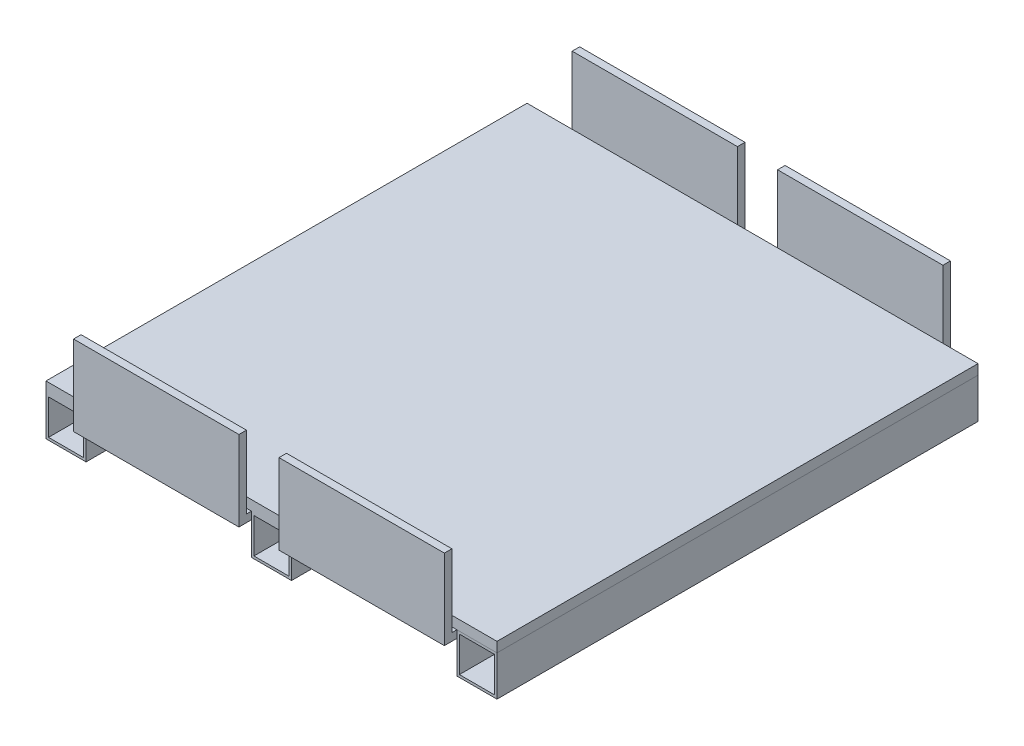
ISO-10303-21;
HEADER;
FILE_DESCRIPTION(('STEP AP214'),'2;1');
FILE_NAME('part.step','',(''),(''),'','','');
FILE_SCHEMA(('AUTOMOTIVE_DESIGN { 1 0 10303 214 1 1 1 1 }'));
ENDSEC;
DATA;
#1=APPLICATION_CONTEXT('core data for automotive mechanical design processes');
#2=APPLICATION_PROTOCOL_DEFINITION('international standard','automotive_design',2000,#1);
#3=PRODUCT_CONTEXT('',#1,'mechanical');
#4=PRODUCT('Part','Part','',(#3));
#5=PRODUCT_RELATED_PRODUCT_CATEGORY('part','',(#4));
#6=PRODUCT_DEFINITION_FORMATION('','',#4);
#7=PRODUCT_DEFINITION_CONTEXT('part definition',#1,'design');
#8=PRODUCT_DEFINITION('design','',#6,#7);
#9=PRODUCT_DEFINITION_SHAPE('','',#8);
#10=(LENGTH_UNIT() NAMED_UNIT(*) SI_UNIT(.MILLI.,.METRE.));
#11=(NAMED_UNIT(*) PLANE_ANGLE_UNIT() SI_UNIT($,.RADIAN.));
#12=(NAMED_UNIT(*) SI_UNIT($,.STERADIAN.) SOLID_ANGLE_UNIT());
#13=UNCERTAINTY_MEASURE_WITH_UNIT(LENGTH_MEASURE(1.E-05),#10,'distance_accuracy_value','');
#14=(GEOMETRIC_REPRESENTATION_CONTEXT(3) GLOBAL_UNCERTAINTY_ASSIGNED_CONTEXT((#13)) GLOBAL_UNIT_ASSIGNED_CONTEXT((#10,
#11,#12)) REPRESENTATION_CONTEXT('',''));
#15=CARTESIAN_POINT('',(0.,0.,0.));
#16=DIRECTION('',(0.,0.,1.));
#17=DIRECTION('',(1.,0.,0.));
#18=AXIS2_PLACEMENT_3D('',#15,#16,#17);
#19=CARTESIAN_POINT('',(50.8,0.,609.6));
#20=DIRECTION('',(-1.,0.,0.));
#21=DIRECTION('',(0.,0.,1.));
#22=AXIS2_PLACEMENT_3D('',#19,#20,#21);
#23=PLANE('',#22);
#24=DIRECTION('',(0.,0.,1.));
#25=VECTOR('',#24,1.);
#26=CARTESIAN_POINT('',(50.8,-19.05,-609.6));
#27=LINE('',#26,#25);
#28=CARTESIAN_POINT('',(50.8,-19.05,-609.6));
#29=VERTEX_POINT('',#28);
#30=CARTESIAN_POINT('',(50.8,-19.05,-488.95));
#31=VERTEX_POINT('',#30);
#32=EDGE_CURVE('E72',#29,#31,#27,.T.);
#33=ORIENTED_EDGE('',*,*,#32,.T.);
#34=DIRECTION('',(0.,1.,0.));
#35=VECTOR('',#34,1.);
#36=CARTESIAN_POINT('',(50.8,0.,-488.95));
#37=LINE('',#36,#35);
#38=CARTESIAN_POINT('',(50.8,0.,-488.95));
#39=VERTEX_POINT('',#38);
#40=EDGE_CURVE('E412',#31,#39,#37,.T.);
#41=ORIENTED_EDGE('',*,*,#40,.T.);
#42=DIRECTION('',(0.,0.,1.));
#43=VECTOR('',#42,1.);
#44=CARTESIAN_POINT('',(50.8,0.,609.6));
#45=LINE('',#44,#43);
#46=CARTESIAN_POINT('',(50.8,0.,488.95));
#47=VERTEX_POINT('',#46);
#48=EDGE_CURVE('E613',#39,#47,#45,.T.);
#49=ORIENTED_EDGE('',*,*,#48,.T.);
#50=DIRECTION('',(0.,1.,0.));
#51=VECTOR('',#50,1.);
#52=CARTESIAN_POINT('',(50.8,0.,488.95));
#53=LINE('',#52,#51);
#54=CARTESIAN_POINT('',(50.8,-19.05,488.95));
#55=VERTEX_POINT('',#54);
#56=EDGE_CURVE('E523',#55,#47,#53,.T.);
#57=ORIENTED_EDGE('',*,*,#56,.F.);
#58=DIRECTION('',(0.,0.,-1.));
#59=VECTOR('',#58,1.);
#60=CARTESIAN_POINT('',(50.8,-19.05,609.6));
#61=LINE('',#60,#59);
#62=CARTESIAN_POINT('',(50.8,-19.05,609.6));
#63=VERTEX_POINT('',#62);
#64=EDGE_CURVE('E12',#63,#55,#61,.T.);
#65=ORIENTED_EDGE('',*,*,#64,.F.);
#66=DIRECTION('',(0.,1.,0.));
#67=VECTOR('',#66,1.);
#68=CARTESIAN_POINT('',(50.8,0.,609.6));
#69=LINE('',#68,#67);
#70=CARTESIAN_POINT('',(50.8,-101.6,609.6));
#71=VERTEX_POINT('',#70);
#72=EDGE_CURVE('E628',#71,#63,#69,.T.);
#73=ORIENTED_EDGE('',*,*,#72,.F.);
#74=DIRECTION('',(0.,0.,-1.));
#75=VECTOR('',#74,1.);
#76=CARTESIAN_POINT('',(50.8,-101.6,609.6));
#77=LINE('',#76,#75);
#78=CARTESIAN_POINT('',(50.8,-101.6,-609.6));
#79=VERTEX_POINT('',#78);
#80=EDGE_CURVE('E620',#71,#79,#77,.T.);
#81=ORIENTED_EDGE('',*,*,#80,.T.);
#82=DIRECTION('',(0.,1.,0.));
#83=VECTOR('',#82,1.);
#84=CARTESIAN_POINT('',(50.8,0.,-609.6));
#85=LINE('',#84,#83);
#86=EDGE_CURVE('E665',#79,#29,#85,.T.);
#87=ORIENTED_EDGE('',*,*,#86,.T.);
#88=EDGE_LOOP('',(#33,#41,#49,#57,#65,#73,#81,#87));
#89=FACE_BOUND('',#88,.T.);
#90=ADVANCED_FACE('F56',(#89),#23,.F.);
#91=CARTESIAN_POINT('',(0.,0.,0.));
#92=DIRECTION('',(0.,-1.,0.));
#93=DIRECTION('',(0.,0.,-1.));
#94=AXIS2_PLACEMENT_3D('',#91,#92,#93);
#95=PLANE('',#94);
#96=ORIENTED_EDGE('',*,*,#48,.F.);
#97=DIRECTION('',(-1.,0.,0.));
#98=VECTOR('',#97,1.);
#99=CARTESIAN_POINT('',(723.9,0.,-488.95));
#100=LINE('',#99,#98);
#101=CARTESIAN_POINT('',(469.9,0.,-488.95));
#102=VERTEX_POINT('',#101);
#103=EDGE_CURVE('E413',#102,#39,#100,.T.);
#104=ORIENTED_EDGE('',*,*,#103,.F.);
#105=DIRECTION('',(0.,0.,-1.));
#106=VECTOR('',#105,1.);
#107=CARTESIAN_POINT('',(469.9,0.,-609.6));
#108=LINE('',#107,#106);
#109=CARTESIAN_POINT('',(469.9,0.,-609.6));
#110=VERTEX_POINT('',#109);
#111=EDGE_CURVE('E381',#102,#110,#108,.T.);
#112=ORIENTED_EDGE('',*,*,#111,.T.);
#113=DIRECTION('',(-1.,0.,0.));
#114=VECTOR('',#113,1.);
#115=CARTESIAN_POINT('',(-571.5,0.,-609.6));
#116=LINE('',#115,#114);
#117=CARTESIAN_POINT('',(571.5,0.,-609.6));
#118=VERTEX_POINT('',#117);
#119=EDGE_CURVE('E597',#118,#110,#116,.T.);
#120=ORIENTED_EDGE('',*,*,#119,.F.);
#121=DIRECTION('',(0.,0.,-1.));
#122=VECTOR('',#121,1.);
#123=CARTESIAN_POINT('',(571.5,0.,609.6));
#124=LINE('',#123,#122);
#125=CARTESIAN_POINT('',(571.5,0.,609.6));
#126=VERTEX_POINT('',#125);
#127=EDGE_CURVE('E541',#126,#118,#124,.T.);
#128=ORIENTED_EDGE('',*,*,#127,.F.);
#129=DIRECTION('',(1.,0.,0.));
#130=VECTOR('',#129,1.);
#131=CARTESIAN_POINT('',(-571.5,0.,609.6));
#132=LINE('',#131,#130);
#133=CARTESIAN_POINT('',(469.9,0.,609.6));
#134=VERTEX_POINT('',#133);
#135=EDGE_CURVE('E601',#134,#126,#132,.T.);
#136=ORIENTED_EDGE('',*,*,#135,.F.);
#137=DIRECTION('',(0.,0.,1.));
#138=VECTOR('',#137,1.);
#139=CARTESIAN_POINT('',(469.9,0.,609.6));
#140=LINE('',#139,#138);
#141=CARTESIAN_POINT('',(469.9,0.,488.95));
#142=VERTEX_POINT('',#141);
#143=EDGE_CURVE('E542',#142,#134,#140,.T.);
#144=ORIENTED_EDGE('',*,*,#143,.F.);
#145=DIRECTION('',(-1.,0.,0.));
#146=VECTOR('',#145,1.);
#147=CARTESIAN_POINT('',(723.9,0.,488.95));
#148=LINE('',#147,#146);
#149=EDGE_CURVE('E522',#142,#47,#148,.T.);
#150=ORIENTED_EDGE('',*,*,#149,.T.);
#151=EDGE_LOOP('',(#96,#104,#112,#120,#128,#136,#144,#150));
#152=FACE_BOUND('',#151,.T.);
#153=ADVANCED_FACE('F918',(#152),#95,.T.);
#154=CARTESIAN_POINT('',(-571.5,0.,609.6));
#155=DIRECTION('',(0.,-1.,0.));
#156=DIRECTION('',(0.,0.,-1.));
#157=AXIS2_PLACEMENT_3D('',#154,#155,#156);
#158=PLANE('',#157);
#159=CARTESIAN_POINT('',(-469.9,0.,609.6));
#160=VERTEX_POINT('',#159);
#161=CARTESIAN_POINT('',(-50.8,0.,609.6));
#162=VERTEX_POINT('',#161);
#163=EDGE_CURVE('E582',#160,#162,#132,.T.);
#164=ORIENTED_EDGE('',*,*,#163,.F.);
#165=DIRECTION('',(0.,0.,1.));
#166=VECTOR('',#165,1.);
#167=CARTESIAN_POINT('',(-469.9,0.,609.6));
#168=LINE('',#167,#166);
#169=CARTESIAN_POINT('',(-469.9,0.,622.3));
#170=VERTEX_POINT('',#169);
#171=EDGE_CURVE('E735',#160,#170,#168,.T.);
#172=ORIENTED_EDGE('',*,*,#171,.T.);
#173=DIRECTION('',(1.,0.,0.));
#174=VECTOR('',#173,1.);
#175=CARTESIAN_POINT('',(-723.9,0.,622.3));
#176=LINE('',#175,#174);
#177=CARTESIAN_POINT('',(-50.8,0.,622.3));
#178=VERTEX_POINT('',#177);
#179=EDGE_CURVE('E734',#170,#178,#176,.T.);
#180=ORIENTED_EDGE('',*,*,#179,.T.);
#181=DIRECTION('',(0.,0.,1.));
#182=VECTOR('',#181,1.);
#183=CARTESIAN_POINT('',(-50.8,0.,609.6));
#184=LINE('',#183,#182);
#185=EDGE_CURVE('E701',#162,#178,#184,.T.);
#186=ORIENTED_EDGE('',*,*,#185,.F.);
#187=EDGE_LOOP('',(#164,#172,#180,#186));
#188=FACE_BOUND('',#187,.T.);
#189=ADVANCED_FACE('F883',(#188),#158,.F.);
#190=CARTESIAN_POINT('',(-469.9,0.,609.6));
#191=DIRECTION('',(-1.,0.,0.));
#192=DIRECTION('',(0.,0.,1.));
#193=AXIS2_PLACEMENT_3D('',#190,#191,#192);
#194=PLANE('',#193);
#195=DIRECTION('',(0.,1.,0.));
#196=VECTOR('',#195,1.);
#197=CARTESIAN_POINT('',(-469.9,0.,-609.6));
#198=LINE('',#197,#196);
#199=CARTESIAN_POINT('',(-469.9,-101.6,-609.6));
#200=VERTEX_POINT('',#199);
#201=CARTESIAN_POINT('',(-469.9,-19.05,-609.6));
#202=VERTEX_POINT('',#201);
#203=EDGE_CURVE('E780',#200,#202,#198,.T.);
#204=ORIENTED_EDGE('',*,*,#203,.T.);
#205=DIRECTION('',(0.,0.,1.));
#206=VECTOR('',#205,1.);
#207=CARTESIAN_POINT('',(-469.9,-19.05,-609.6));
#208=LINE('',#207,#206);
#209=CARTESIAN_POINT('',(-469.9,-19.05,-488.95));
#210=VERTEX_POINT('',#209);
#211=EDGE_CURVE('E80',#202,#210,#208,.T.);
#212=ORIENTED_EDGE('',*,*,#211,.T.);
#213=DIRECTION('',(0.,1.,0.));
#214=VECTOR('',#213,1.);
#215=CARTESIAN_POINT('',(-469.9,0.,-488.95));
#216=LINE('',#215,#214);
#217=CARTESIAN_POINT('',(-469.9,0.,-488.95));
#218=VERTEX_POINT('',#217);
#219=EDGE_CURVE('E484',#210,#218,#216,.T.);
#220=ORIENTED_EDGE('',*,*,#219,.T.);
#221=DIRECTION('',(0.,0.,-1.));
#222=VECTOR('',#221,1.);
#223=CARTESIAN_POINT('',(-469.9,0.,609.6));
#224=LINE('',#223,#222);
#225=CARTESIAN_POINT('',(-469.9,0.,488.95));
#226=VERTEX_POINT('',#225);
#227=EDGE_CURVE('E820',#226,#218,#224,.T.);
#228=ORIENTED_EDGE('',*,*,#227,.F.);
#229=DIRECTION('',(0.,1.,0.));
#230=VECTOR('',#229,1.);
#231=CARTESIAN_POINT('',(-469.9,0.,488.95));
#232=LINE('',#231,#230);
#233=CARTESIAN_POINT('',(-469.9,-19.05,488.95));
#234=VERTEX_POINT('',#233);
#235=EDGE_CURVE('E739',#234,#226,#232,.T.);
#236=ORIENTED_EDGE('',*,*,#235,.F.);
#237=DIRECTION('',(0.,0.,-1.));
#238=VECTOR('',#237,1.);
#239=CARTESIAN_POINT('',(-469.9,-19.05,609.6));
#240=LINE('',#239,#238);
#241=CARTESIAN_POINT('',(-469.9,-19.05,609.6));
#242=VERTEX_POINT('',#241);
#243=EDGE_CURVE('E65',#242,#234,#240,.T.);
#244=ORIENTED_EDGE('',*,*,#243,.F.);
#245=DIRECTION('',(0.,1.,0.));
#246=VECTOR('',#245,1.);
#247=CARTESIAN_POINT('',(-469.9,0.,609.6));
#248=LINE('',#247,#246);
#249=CARTESIAN_POINT('',(-469.9,-101.6,609.6));
#250=VERTEX_POINT('',#249);
#251=EDGE_CURVE('E816',#250,#242,#248,.T.);
#252=ORIENTED_EDGE('',*,*,#251,.F.);
#253=DIRECTION('',(0.,0.,-1.));
#254=VECTOR('',#253,1.);
#255=CARTESIAN_POINT('',(-469.9,-101.6,609.6));
#256=LINE('',#255,#254);
#257=EDGE_CURVE('E823',#250,#200,#256,.T.);
#258=ORIENTED_EDGE('',*,*,#257,.T.);
#259=EDGE_LOOP('',(#204,#212,#220,#228,#236,#244,#252,#258));
#260=FACE_BOUND('',#259,.T.);
#261=ADVANCED_FACE('F903',(#260),#194,.F.);
#262=CARTESIAN_POINT('',(0.,0.,609.6));
#263=DIRECTION('',(0.,0.,1.));
#264=DIRECTION('',(1.,0.,0.));
#265=AXIS2_PLACEMENT_3D('',#262,#263,#264);
#266=PLANE('',#265);
#267=DIRECTION('',(0.,-1.,0.));
#268=VECTOR('',#267,1.);
#269=CARTESIAN_POINT('',(-571.5,0.,609.6));
#270=LINE('',#269,#268);
#271=CARTESIAN_POINT('',(-571.5,25.4,609.6));
#272=VERTEX_POINT('',#271);
#273=CARTESIAN_POINT('',(-571.5,-101.6,609.6));
#274=VERTEX_POINT('',#273);
#275=EDGE_CURVE('E808',#272,#274,#270,.T.);
#276=ORIENTED_EDGE('',*,*,#275,.T.);
#277=DIRECTION('',(1.,0.,0.));
#278=VECTOR('',#277,1.);
#279=CARTESIAN_POINT('',(-571.5,-101.6,609.6));
#280=LINE('',#279,#278);
#281=EDGE_CURVE('E812',#274,#250,#280,.T.);
#282=ORIENTED_EDGE('',*,*,#281,.T.);
#283=ORIENTED_EDGE('',*,*,#251,.T.);
#284=EDGE_CURVE('E815',#242,#160,#248,.T.);
#285=ORIENTED_EDGE('',*,*,#284,.T.);
#286=ORIENTED_EDGE('',*,*,#163,.T.);
#287=DIRECTION('',(0.,-1.,0.));
#288=VECTOR('',#287,1.);
#289=CARTESIAN_POINT('',(-50.8,0.,609.6));
#290=LINE('',#289,#288);
#291=CARTESIAN_POINT('',(-50.8,-19.05,609.6));
#292=VERTEX_POINT('',#291);
#293=EDGE_CURVE('E636',#162,#292,#290,.T.);
#294=ORIENTED_EDGE('',*,*,#293,.T.);
#295=CARTESIAN_POINT('',(-50.8,-101.6,609.6));
#296=VERTEX_POINT('',#295);
#297=EDGE_CURVE('E635',#292,#296,#290,.T.);
#298=ORIENTED_EDGE('',*,*,#297,.T.);
#299=DIRECTION('',(1.,0.,0.));
#300=VECTOR('',#299,1.);
#301=CARTESIAN_POINT('',(-50.8,-101.6,609.6));
#302=LINE('',#301,#300);
#303=EDGE_CURVE('E632',#296,#71,#302,.T.);
#304=ORIENTED_EDGE('',*,*,#303,.T.);
#305=ORIENTED_EDGE('',*,*,#72,.T.);
#306=CARTESIAN_POINT('',(50.8,0.,609.6));
#307=VERTEX_POINT('',#306);
#308=EDGE_CURVE('E627',#63,#307,#69,.T.);
#309=ORIENTED_EDGE('',*,*,#308,.T.);
#310=EDGE_CURVE('E605',#307,#134,#132,.T.);
#311=ORIENTED_EDGE('',*,*,#310,.T.);
#312=ORIENTED_EDGE('',*,*,#135,.T.);
#313=DIRECTION('',(0.,-1.,0.));
#314=VECTOR('',#313,1.);
#315=CARTESIAN_POINT('',(571.5,25.4,609.6));
#316=LINE('',#315,#314);
#317=CARTESIAN_POINT('',(571.5,25.4,609.6));
#318=VERTEX_POINT('',#317);
#319=EDGE_CURVE('E593',#318,#126,#316,.T.);
#320=ORIENTED_EDGE('',*,*,#319,.F.);
#321=DIRECTION('',(1.,0.,0.));
#322=VECTOR('',#321,1.);
#323=CARTESIAN_POINT('',(-571.5,25.4,609.6));
#324=LINE('',#323,#322);
#325=EDGE_CURVE('E590',#272,#318,#324,.T.);
#326=ORIENTED_EDGE('',*,*,#325,.F.);
#327=EDGE_LOOP('',(#276,#282,#283,#285,#286,#294,#298,#304,#305,#309,#311,#312,#320,#326));
#328=FACE_BOUND('',#327,.T.);
#329=DIRECTION('',(1.,0.,0.));
#330=VECTOR('',#329,1.);
#331=CARTESIAN_POINT('',(-565.15,-95.25,609.6));
#332=LINE('',#331,#330);
#333=CARTESIAN_POINT('',(-565.15,-95.25,609.6));
#334=VERTEX_POINT('',#333);
#335=CARTESIAN_POINT('',(-476.25,-95.25,609.6));
#336=VERTEX_POINT('',#335);
#337=EDGE_CURVE('E786',#334,#336,#332,.T.);
#338=ORIENTED_EDGE('',*,*,#337,.F.);
#339=DIRECTION('',(0.,-1.,0.));
#340=VECTOR('',#339,1.);
#341=CARTESIAN_POINT('',(-565.15,-6.35,609.6));
#342=LINE('',#341,#340);
#343=CARTESIAN_POINT('',(-565.15,-6.35,609.6));
#344=VERTEX_POINT('',#343);
#345=EDGE_CURVE('E783',#344,#334,#342,.T.);
#346=ORIENTED_EDGE('',*,*,#345,.F.);
#347=DIRECTION('',(-1.,0.,0.));
#348=VECTOR('',#347,1.);
#349=CARTESIAN_POINT('',(-565.15,-6.35,609.6));
#350=LINE('',#349,#348);
#351=CARTESIAN_POINT('',(-476.25,-6.35,609.6));
#352=VERTEX_POINT('',#351);
#353=EDGE_CURVE('E793',#352,#344,#350,.T.);
#354=ORIENTED_EDGE('',*,*,#353,.F.);
#355=DIRECTION('',(0.,1.,0.));
#356=VECTOR('',#355,1.);
#357=CARTESIAN_POINT('',(-476.25,-6.35,609.6));
#358=LINE('',#357,#356);
#359=EDGE_CURVE('E789',#336,#352,#358,.T.);
#360=ORIENTED_EDGE('',*,*,#359,.F.);
#361=EDGE_LOOP('',(#338,#346,#354,#360));
#362=FACE_BOUND('',#361,.T.);
#363=DIRECTION('',(1.,0.,0.));
#364=VECTOR('',#363,1.);
#365=CARTESIAN_POINT('',(-44.45,-95.25,609.6));
#366=LINE('',#365,#364);
#367=CARTESIAN_POINT('',(-44.45,-95.25,609.6));
#368=VERTEX_POINT('',#367);
#369=CARTESIAN_POINT('',(44.45,-95.25,609.6));
#370=VERTEX_POINT('',#369);
#371=EDGE_CURVE('E659',#368,#370,#366,.T.);
#372=ORIENTED_EDGE('',*,*,#371,.F.);
#373=DIRECTION('',(0.,-1.,0.));
#374=VECTOR('',#373,1.);
#375=CARTESIAN_POINT('',(-44.45,-6.35000000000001,609.6));
#376=LINE('',#375,#374);
#377=CARTESIAN_POINT('',(-44.45,-6.35000000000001,609.6));
#378=VERTEX_POINT('',#377);
#379=EDGE_CURVE('E662',#378,#368,#376,.T.);
#380=ORIENTED_EDGE('',*,*,#379,.F.);
#381=DIRECTION('',(-1.,0.,0.));
#382=VECTOR('',#381,1.);
#383=CARTESIAN_POINT('',(-44.45,-6.35000000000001,609.6));
#384=LINE('',#383,#382);
#385=CARTESIAN_POINT('',(44.45,-6.35000000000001,609.6));
#386=VERTEX_POINT('',#385);
#387=EDGE_CURVE('E652',#386,#378,#384,.T.);
#388=ORIENTED_EDGE('',*,*,#387,.F.);
#389=DIRECTION('',(0.,1.,0.));
#390=VECTOR('',#389,1.);
#391=CARTESIAN_POINT('',(44.45,-6.35000000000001,609.6));
#392=LINE('',#391,#390);
#393=EDGE_CURVE('E655',#370,#386,#392,.T.);
#394=ORIENTED_EDGE('',*,*,#393,.F.);
#395=EDGE_LOOP('',(#372,#380,#388,#394));
#396=FACE_BOUND('',#395,.T.);
#397=ADVANCED_FACE('F875',(#328,#362,#396),#266,.T.);
#398=CARTESIAN_POINT('',(-571.5,0.,609.6));
#399=DIRECTION('',(1.,0.,0.));
#400=DIRECTION('',(0.,0.,-1.));
#401=AXIS2_PLACEMENT_3D('',#398,#399,#400);
#402=PLANE('',#401);
#403=ORIENTED_EDGE('',*,*,#275,.F.);
#404=DIRECTION('',(0.,0.,1.));
#405=VECTOR('',#404,1.);
#406=CARTESIAN_POINT('',(-571.5,25.4,609.6));
#407=LINE('',#406,#405);
#408=CARTESIAN_POINT('',(-571.5,25.4,-609.6));
#409=VERTEX_POINT('',#408);
#410=EDGE_CURVE('E586',#409,#272,#407,.T.);
#411=ORIENTED_EDGE('',*,*,#410,.F.);
#412=DIRECTION('',(0.,-1.,0.));
#413=VECTOR('',#412,1.);
#414=CARTESIAN_POINT('',(-571.5,0.,-609.6));
#415=LINE('',#414,#413);
#416=CARTESIAN_POINT('',(-571.5,-101.6,-609.6));
#417=VERTEX_POINT('',#416);
#418=EDGE_CURVE('E772',#409,#417,#415,.T.);
#419=ORIENTED_EDGE('',*,*,#418,.T.);
#420=DIRECTION('',(0.,0.,-1.));
#421=VECTOR('',#420,1.);
#422=CARTESIAN_POINT('',(-571.5,-101.6,609.6));
#423=LINE('',#422,#421);
#424=EDGE_CURVE('E825',#274,#417,#423,.T.);
#425=ORIENTED_EDGE('',*,*,#424,.F.);
#426=EDGE_LOOP('',(#403,#411,#419,#425));
#427=FACE_BOUND('',#426,.T.);
#428=ADVANCED_FACE('F58',(#427),#402,.F.);
#429=CARTESIAN_POINT('',(-571.5,-101.6,609.6));
#430=DIRECTION('',(0.,1.,0.));
#431=DIRECTION('',(0.,0.,1.));
#432=AXIS2_PLACEMENT_3D('',#429,#430,#431);
#433=PLANE('',#432);
#434=ORIENTED_EDGE('',*,*,#424,.T.);
#435=DIRECTION('',(1.,0.,0.));
#436=VECTOR('',#435,1.);
#437=CARTESIAN_POINT('',(-571.5,-101.6,-609.6));
#438=LINE('',#437,#436);
#439=EDGE_CURVE('E776',#417,#200,#438,.T.);
#440=ORIENTED_EDGE('',*,*,#439,.T.);
#441=ORIENTED_EDGE('',*,*,#257,.F.);
#442=ORIENTED_EDGE('',*,*,#281,.F.);
#443=EDGE_LOOP('',(#434,#440,#441,#442));
#444=FACE_BOUND('',#443,.T.);
#445=ADVANCED_FACE('F905',(#444),#433,.F.);
#446=CARTESIAN_POINT('',(-565.15,-6.35,609.6));
#447=DIRECTION('',(1.,0.,0.));
#448=DIRECTION('',(0.,0.,-1.));
#449=AXIS2_PLACEMENT_3D('',#446,#447,#448);
#450=PLANE('',#449);
#451=DIRECTION('',(0.,0.,-1.));
#452=VECTOR('',#451,1.);
#453=CARTESIAN_POINT('',(-565.15,-95.25,609.6));
#454=LINE('',#453,#452);
#455=CARTESIAN_POINT('',(-565.15,-95.25,-609.6));
#456=VERTEX_POINT('',#455);
#457=EDGE_CURVE('E805',#334,#456,#454,.T.);
#458=ORIENTED_EDGE('',*,*,#457,.T.);
#459=DIRECTION('',(0.,-1.,0.));
#460=VECTOR('',#459,1.);
#461=CARTESIAN_POINT('',(-565.15,-6.35,-609.6));
#462=LINE('',#461,#460);
#463=CARTESIAN_POINT('',(-565.15,-6.35,-609.6));
#464=VERTEX_POINT('',#463);
#465=EDGE_CURVE('E756',#464,#456,#462,.T.);
#466=ORIENTED_EDGE('',*,*,#465,.F.);
#467=DIRECTION('',(0.,0.,-1.));
#468=VECTOR('',#467,1.);
#469=CARTESIAN_POINT('',(-565.15,-6.35,609.6));
#470=LINE('',#469,#468);
#471=EDGE_CURVE('E796',#344,#464,#470,.T.);
#472=ORIENTED_EDGE('',*,*,#471,.F.);
#473=ORIENTED_EDGE('',*,*,#345,.T.);
#474=EDGE_LOOP('',(#458,#466,#472,#473));
#475=FACE_BOUND('',#474,.T.);
#476=ADVANCED_FACE('F907',(#475),#450,.T.);
#477=CARTESIAN_POINT('',(-565.15,-95.25,609.6));
#478=DIRECTION('',(0.,1.,0.));
#479=DIRECTION('',(0.,0.,1.));
#480=AXIS2_PLACEMENT_3D('',#477,#478,#479);
#481=PLANE('',#480);
#482=DIRECTION('',(0.,0.,-1.));
#483=VECTOR('',#482,1.);
#484=CARTESIAN_POINT('',(-476.25,-95.25,609.6));
#485=LINE('',#484,#483);
#486=CARTESIAN_POINT('',(-476.25,-95.25,-609.6));
#487=VERTEX_POINT('',#486);
#488=EDGE_CURVE('E802',#336,#487,#485,.T.);
#489=ORIENTED_EDGE('',*,*,#488,.T.);
#490=DIRECTION('',(1.,0.,0.));
#491=VECTOR('',#490,1.);
#492=CARTESIAN_POINT('',(-565.15,-95.25,-609.6));
#493=LINE('',#492,#491);
#494=EDGE_CURVE('E760',#456,#487,#493,.T.);
#495=ORIENTED_EDGE('',*,*,#494,.F.);
#496=ORIENTED_EDGE('',*,*,#457,.F.);
#497=ORIENTED_EDGE('',*,*,#337,.T.);
#498=EDGE_LOOP('',(#489,#495,#496,#497));
#499=FACE_BOUND('',#498,.T.);
#500=ADVANCED_FACE('F911',(#499),#481,.T.);
#501=CARTESIAN_POINT('',(-476.25,-6.35,609.6));
#502=DIRECTION('',(-1.,0.,0.));
#503=DIRECTION('',(0.,0.,1.));
#504=AXIS2_PLACEMENT_3D('',#501,#502,#503);
#505=PLANE('',#504);
#506=DIRECTION('',(0.,0.,-1.));
#507=VECTOR('',#506,1.);
#508=CARTESIAN_POINT('',(-476.25,-6.35,609.6));
#509=LINE('',#508,#507);
#510=CARTESIAN_POINT('',(-476.25,-6.35,-609.6));
#511=VERTEX_POINT('',#510);
#512=EDGE_CURVE('E799',#352,#511,#509,.T.);
#513=ORIENTED_EDGE('',*,*,#512,.T.);
#514=DIRECTION('',(0.,1.,0.));
#515=VECTOR('',#514,1.);
#516=CARTESIAN_POINT('',(-476.25,-6.35,-609.6));
#517=LINE('',#516,#515);
#518=EDGE_CURVE('E764',#487,#511,#517,.T.);
#519=ORIENTED_EDGE('',*,*,#518,.F.);
#520=ORIENTED_EDGE('',*,*,#488,.F.);
#521=ORIENTED_EDGE('',*,*,#359,.T.);
#522=EDGE_LOOP('',(#513,#519,#520,#521));
#523=FACE_BOUND('',#522,.T.);
#524=ADVANCED_FACE('F966',(#523),#505,.T.);
#525=CARTESIAN_POINT('',(-565.15,-6.35,609.6));
#526=DIRECTION('',(0.,-1.,0.));
#527=DIRECTION('',(0.,0.,-1.));
#528=AXIS2_PLACEMENT_3D('',#525,#526,#527);
#529=PLANE('',#528);
#530=ORIENTED_EDGE('',*,*,#471,.T.);
#531=DIRECTION('',(-1.,0.,0.));
#532=VECTOR('',#531,1.);
#533=CARTESIAN_POINT('',(-565.15,-6.35,-609.6));
#534=LINE('',#533,#532);
#535=EDGE_CURVE('E768',#511,#464,#534,.T.);
#536=ORIENTED_EDGE('',*,*,#535,.F.);
#537=ORIENTED_EDGE('',*,*,#512,.F.);
#538=ORIENTED_EDGE('',*,*,#353,.T.);
#539=EDGE_LOOP('',(#530,#536,#537,#538));
#540=FACE_BOUND('',#539,.T.);
#541=ADVANCED_FACE('F962',(#540),#529,.T.);
#542=CARTESIAN_POINT('',(0.,0.,-609.6));
#543=DIRECTION('',(0.,0.,1.));
#544=DIRECTION('',(1.,0.,0.));
#545=AXIS2_PLACEMENT_3D('',#542,#543,#544);
#546=PLANE('',#545);
#547=ORIENTED_EDGE('',*,*,#535,.T.);
#548=ORIENTED_EDGE('',*,*,#465,.T.);
#549=ORIENTED_EDGE('',*,*,#494,.T.);
#550=ORIENTED_EDGE('',*,*,#518,.T.);
#551=EDGE_LOOP('',(#547,#548,#549,#550));
#552=FACE_BOUND('',#551,.T.);
#553=ORIENTED_EDGE('',*,*,#418,.F.);
#554=DIRECTION('',(-1.,0.,0.));
#555=VECTOR('',#554,1.);
#556=CARTESIAN_POINT('',(-571.5,25.4,-609.6));
#557=LINE('',#556,#555);
#558=CARTESIAN_POINT('',(571.5,25.4,-609.6));
#559=VERTEX_POINT('',#558);
#560=EDGE_CURVE('E581',#559,#409,#557,.T.);
#561=ORIENTED_EDGE('',*,*,#560,.F.);
#562=DIRECTION('',(0.,-1.,0.));
#563=VECTOR('',#562,1.);
#564=CARTESIAN_POINT('',(571.5,25.4,-609.6));
#565=LINE('',#564,#563);
#566=EDGE_CURVE('E609',#559,#118,#565,.T.);
#567=ORIENTED_EDGE('',*,*,#566,.T.);
#568=ORIENTED_EDGE('',*,*,#119,.T.);
#569=DIRECTION('',(1.,0.,0.));
#570=VECTOR('',#569,1.);
#571=CARTESIAN_POINT('',(-571.5,0.,-609.6));
#572=LINE('',#571,#570);
#573=CARTESIAN_POINT('',(50.8,0.,-609.6));
#574=VERTEX_POINT('',#573);
#575=EDGE_CURVE('E380',#574,#110,#572,.T.);
#576=ORIENTED_EDGE('',*,*,#575,.F.);
#577=DIRECTION('',(0.,1.,0.));
#578=VECTOR('',#577,1.);
#579=CARTESIAN_POINT('',(50.8,0.,-609.6));
#580=LINE('',#579,#578);
#581=EDGE_CURVE('E425',#29,#574,#580,.T.);
#582=ORIENTED_EDGE('',*,*,#581,.F.);
#583=ORIENTED_EDGE('',*,*,#86,.F.);
#584=DIRECTION('',(1.,0.,0.));
#585=VECTOR('',#584,1.);
#586=CARTESIAN_POINT('',(-50.8,-101.6,-609.6));
#587=LINE('',#586,#585);
#588=CARTESIAN_POINT('',(-50.8,-101.6,-609.6));
#589=VERTEX_POINT('',#588);
#590=EDGE_CURVE('E668',#589,#79,#587,.T.);
#591=ORIENTED_EDGE('',*,*,#590,.F.);
#592=DIRECTION('',(0.,-1.,0.));
#593=VECTOR('',#592,1.);
#594=CARTESIAN_POINT('',(-50.8,0.,-609.6));
#595=LINE('',#594,#593);
#596=CARTESIAN_POINT('',(-50.8,-19.05,-609.6));
#597=VERTEX_POINT('',#596);
#598=EDGE_CURVE('E672',#597,#589,#595,.T.);
#599=ORIENTED_EDGE('',*,*,#598,.F.);
#600=DIRECTION('',(0.,-1.,0.));
#601=VECTOR('',#600,1.);
#602=CARTESIAN_POINT('',(-50.8,0.,-609.6));
#603=LINE('',#602,#601);
#604=CARTESIAN_POINT('',(-50.8,0.,-609.6));
#605=VERTEX_POINT('',#604);
#606=EDGE_CURVE('E429',#605,#597,#603,.T.);
#607=ORIENTED_EDGE('',*,*,#606,.F.);
#608=CARTESIAN_POINT('',(-469.9,0.,-609.6));
#609=VERTEX_POINT('',#608);
#610=EDGE_CURVE('E386',#609,#605,#572,.T.);
#611=ORIENTED_EDGE('',*,*,#610,.F.);
#612=DIRECTION('',(0.,1.,0.));
#613=VECTOR('',#612,1.);
#614=CARTESIAN_POINT('',(-469.9,0.,-609.6));
#615=LINE('',#614,#613);
#616=EDGE_CURVE('E501',#202,#609,#615,.T.);
#617=ORIENTED_EDGE('',*,*,#616,.F.);
#618=ORIENTED_EDGE('',*,*,#203,.F.);
#619=ORIENTED_EDGE('',*,*,#439,.F.);
#620=EDGE_LOOP('',(#553,#561,#567,#568,#576,#582,#583,#591,#599,#607,#611,#617,#618,#619));
#621=FACE_BOUND('',#620,.T.);
#622=DIRECTION('',(-1.,0.,0.));
#623=VECTOR('',#622,1.);
#624=CARTESIAN_POINT('',(-44.45,-6.35000000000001,-609.6));
#625=LINE('',#624,#623);
#626=CARTESIAN_POINT('',(44.45,-6.35000000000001,-609.6));
#627=VERTEX_POINT('',#626);
#628=CARTESIAN_POINT('',(-44.45,-6.35000000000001,-609.6));
#629=VERTEX_POINT('',#628);
#630=EDGE_CURVE('E675',#627,#629,#625,.T.);
#631=ORIENTED_EDGE('',*,*,#630,.T.);
#632=DIRECTION('',(0.,-1.,0.));
#633=VECTOR('',#632,1.);
#634=CARTESIAN_POINT('',(-44.45,-6.35000000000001,-609.6));
#635=LINE('',#634,#633);
#636=CARTESIAN_POINT('',(-44.45,-95.25,-609.6));
#637=VERTEX_POINT('',#636);
#638=EDGE_CURVE('E687',#629,#637,#635,.T.);
#639=ORIENTED_EDGE('',*,*,#638,.T.);
#640=DIRECTION('',(1.,0.,0.));
#641=VECTOR('',#640,1.);
#642=CARTESIAN_POINT('',(-44.45,-95.25,-609.6));
#643=LINE('',#642,#641);
#644=CARTESIAN_POINT('',(44.45,-95.25,-609.6));
#645=VERTEX_POINT('',#644);
#646=EDGE_CURVE('E683',#637,#645,#643,.T.);
#647=ORIENTED_EDGE('',*,*,#646,.T.);
#648=DIRECTION('',(0.,1.,0.));
#649=VECTOR('',#648,1.);
#650=CARTESIAN_POINT('',(44.45,-6.35000000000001,-609.6));
#651=LINE('',#650,#649);
#652=EDGE_CURVE('E679',#645,#627,#651,.T.);
#653=ORIENTED_EDGE('',*,*,#652,.T.);
#654=EDGE_LOOP('',(#631,#639,#647,#653));
#655=FACE_BOUND('',#654,.T.);
#656=ADVANCED_FACE('F865',(#552,#621,#655),#546,.F.);
#657=CARTESIAN_POINT('',(-469.9,0.,609.6));
#658=DIRECTION('',(-1.,0.,0.));
#659=DIRECTION('',(0.,0.,1.));
#660=AXIS2_PLACEMENT_3D('',#657,#658,#659);
#661=PLANE('',#660);
#662=ORIENTED_EDGE('',*,*,#284,.F.);
#663=CARTESIAN_POINT('',(-469.9,-19.05,641.35));
#664=VERTEX_POINT('',#663);
#665=EDGE_CURVE('E696',#664,#242,#240,.T.);
#666=ORIENTED_EDGE('',*,*,#665,.F.);
#667=DIRECTION('',(0.,-1.,0.));
#668=VECTOR('',#667,1.);
#669=CARTESIAN_POINT('',(-469.9,0.,641.35));
#670=LINE('',#669,#668);
#671=CARTESIAN_POINT('',(-469.9,184.15,641.35));
#672=VERTEX_POINT('',#671);
#673=EDGE_CURVE('E719',#672,#664,#670,.T.);
#674=ORIENTED_EDGE('',*,*,#673,.F.);
#675=DIRECTION('',(0.,0.,1.));
#676=VECTOR('',#675,1.);
#677=CARTESIAN_POINT('',(-469.9,184.15,609.6));
#678=LINE('',#677,#676);
#679=CARTESIAN_POINT('',(-469.9,184.15,622.3));
#680=VERTEX_POINT('',#679);
#681=EDGE_CURVE('E725',#680,#672,#678,.T.);
#682=ORIENTED_EDGE('',*,*,#681,.F.);
#683=DIRECTION('',(0.,1.,0.));
#684=VECTOR('',#683,1.);
#685=CARTESIAN_POINT('',(-469.9,0.,622.3));
#686=LINE('',#685,#684);
#687=EDGE_CURVE('E730',#170,#680,#686,.T.);
#688=ORIENTED_EDGE('',*,*,#687,.F.);
#689=ORIENTED_EDGE('',*,*,#171,.F.);
#690=EDGE_LOOP('',(#662,#666,#674,#682,#688,#689));
#691=FACE_BOUND('',#690,.T.);
#692=ADVANCED_FACE('F900',(#691),#661,.T.);
#693=CARTESIAN_POINT('',(-50.8,0.,0.));
#694=DIRECTION('',(1.,0.,0.));
#695=DIRECTION('',(0.,0.,-1.));
#696=AXIS2_PLACEMENT_3D('',#693,#694,#695);
#697=PLANE('',#696);
#698=ORIENTED_EDGE('',*,*,#293,.F.);
#699=ORIENTED_EDGE('',*,*,#185,.T.);
#700=DIRECTION('',(0.,1.,0.));
#701=VECTOR('',#700,1.);
#702=CARTESIAN_POINT('',(-50.8,0.,622.3));
#703=LINE('',#702,#701);
#704=CARTESIAN_POINT('',(-50.8,184.15,622.3));
#705=VERTEX_POINT('',#704);
#706=EDGE_CURVE('E697',#178,#705,#703,.T.);
#707=ORIENTED_EDGE('',*,*,#706,.T.);
#708=DIRECTION('',(0.,0.,1.));
#709=VECTOR('',#708,1.);
#710=CARTESIAN_POINT('',(-50.8,184.15,609.6));
#711=LINE('',#710,#709);
#712=CARTESIAN_POINT('',(-50.8,184.15,641.35));
#713=VERTEX_POINT('',#712);
#714=EDGE_CURVE('E692',#705,#713,#711,.T.);
#715=ORIENTED_EDGE('',*,*,#714,.T.);
#716=DIRECTION('',(0.,-1.,0.));
#717=VECTOR('',#716,1.);
#718=CARTESIAN_POINT('',(-50.8,0.,641.35));
#719=LINE('',#718,#717);
#720=CARTESIAN_POINT('',(-50.8,-19.05,641.35));
#721=VERTEX_POINT('',#720);
#722=EDGE_CURVE('E691',#713,#721,#719,.T.);
#723=ORIENTED_EDGE('',*,*,#722,.T.);
#724=DIRECTION('',(0.,0.,-1.));
#725=VECTOR('',#724,1.);
#726=CARTESIAN_POINT('',(-50.8,-19.05,609.6));
#727=LINE('',#726,#725);
#728=EDGE_CURVE('E708',#721,#292,#727,.T.);
#729=ORIENTED_EDGE('',*,*,#728,.T.);
#730=EDGE_LOOP('',(#698,#699,#707,#715,#723,#729));
#731=FACE_BOUND('',#730,.T.);
#732=ADVANCED_FACE('F881',(#731),#697,.T.);
#733=CARTESIAN_POINT('',(-723.9,-19.05,609.6));
#734=DIRECTION('',(0.,-1.,0.));
#735=DIRECTION('',(0.,0.,-1.));
#736=AXIS2_PLACEMENT_3D('',#733,#734,#735);
#737=PLANE('',#736);
#738=DIRECTION('',(1.,0.,0.));
#739=VECTOR('',#738,1.);
#740=CARTESIAN_POINT('',(-723.9,-19.05,641.35));
#741=LINE('',#740,#739);
#742=EDGE_CURVE('E723',#664,#721,#741,.T.);
#743=ORIENTED_EDGE('',*,*,#742,.F.);
#744=ORIENTED_EDGE('',*,*,#665,.T.);
#745=ORIENTED_EDGE('',*,*,#243,.T.);
#746=DIRECTION('',(1.,0.,0.));
#747=VECTOR('',#746,1.);
#748=CARTESIAN_POINT('',(-723.9,-19.05,488.95));
#749=LINE('',#748,#747);
#750=CARTESIAN_POINT('',(-50.8,-19.05,488.95));
#751=VERTEX_POINT('',#750);
#752=EDGE_CURVE('E718',#234,#751,#749,.T.);
#753=ORIENTED_EDGE('',*,*,#752,.T.);
#754=EDGE_CURVE('E711',#292,#751,#727,.T.);
#755=ORIENTED_EDGE('',*,*,#754,.F.);
#756=ORIENTED_EDGE('',*,*,#728,.F.);
#757=EDGE_LOOP('',(#743,#744,#745,#753,#755,#756));
#758=FACE_BOUND('',#757,.T.);
#759=ADVANCED_FACE('F835',(#758),#737,.T.);
#760=CARTESIAN_POINT('',(-723.9,0.,488.95));
#761=DIRECTION('',(0.,0.,-1.));
#762=DIRECTION('',(-1.,0.,0.));
#763=AXIS2_PLACEMENT_3D('',#760,#761,#762);
#764=PLANE('',#763);
#765=ORIENTED_EDGE('',*,*,#752,.F.);
#766=ORIENTED_EDGE('',*,*,#235,.T.);
#767=DIRECTION('',(1.,0.,0.));
#768=VECTOR('',#767,1.);
#769=CARTESIAN_POINT('',(-723.9,0.,488.95));
#770=LINE('',#769,#768);
#771=CARTESIAN_POINT('',(-50.8,0.,488.95));
#772=VERTEX_POINT('',#771);
#773=EDGE_CURVE('E738',#226,#772,#770,.T.);
#774=ORIENTED_EDGE('',*,*,#773,.T.);
#775=DIRECTION('',(0.,1.,0.));
#776=VECTOR('',#775,1.);
#777=CARTESIAN_POINT('',(-50.8,0.,488.95));
#778=LINE('',#777,#776);
#779=EDGE_CURVE('E704',#751,#772,#778,.T.);
#780=ORIENTED_EDGE('',*,*,#779,.F.);
#781=EDGE_LOOP('',(#765,#766,#774,#780));
#782=FACE_BOUND('',#781,.T.);
#783=ADVANCED_FACE('F840',(#782),#764,.T.);
#784=CARTESIAN_POINT('',(-723.9,0.,622.3));
#785=DIRECTION('',(0.,0.,-1.));
#786=DIRECTION('',(-1.,0.,0.));
#787=AXIS2_PLACEMENT_3D('',#784,#785,#786);
#788=PLANE('',#787);
#789=ORIENTED_EDGE('',*,*,#179,.F.);
#790=ORIENTED_EDGE('',*,*,#687,.T.);
#791=DIRECTION('',(1.,0.,0.));
#792=VECTOR('',#791,1.);
#793=CARTESIAN_POINT('',(-723.9,184.15,622.3));
#794=LINE('',#793,#792);
#795=EDGE_CURVE('E729',#680,#705,#794,.T.);
#796=ORIENTED_EDGE('',*,*,#795,.T.);
#797=ORIENTED_EDGE('',*,*,#706,.F.);
#798=EDGE_LOOP('',(#789,#790,#796,#797));
#799=FACE_BOUND('',#798,.T.);
#800=ADVANCED_FACE('F889',(#799),#788,.T.);
#801=CARTESIAN_POINT('',(-723.9,184.15,609.6));
#802=DIRECTION('',(0.,1.,0.));
#803=DIRECTION('',(0.,0.,1.));
#804=AXIS2_PLACEMENT_3D('',#801,#802,#803);
#805=PLANE('',#804);
#806=ORIENTED_EDGE('',*,*,#795,.F.);
#807=ORIENTED_EDGE('',*,*,#681,.T.);
#808=DIRECTION('',(1.,0.,0.));
#809=VECTOR('',#808,1.);
#810=CARTESIAN_POINT('',(-723.9,184.15,641.35));
#811=LINE('',#810,#809);
#812=EDGE_CURVE('E724',#672,#713,#811,.T.);
#813=ORIENTED_EDGE('',*,*,#812,.T.);
#814=ORIENTED_EDGE('',*,*,#714,.F.);
#815=EDGE_LOOP('',(#806,#807,#813,#814));
#816=FACE_BOUND('',#815,.T.);
#817=ADVANCED_FACE('F893',(#816),#805,.T.);
#818=CARTESIAN_POINT('',(-723.9,0.,641.35));
#819=DIRECTION('',(0.,0.,1.));
#820=DIRECTION('',(1.,0.,0.));
#821=AXIS2_PLACEMENT_3D('',#818,#819,#820);
#822=PLANE('',#821);
#823=ORIENTED_EDGE('',*,*,#812,.F.);
#824=ORIENTED_EDGE('',*,*,#673,.T.);
#825=ORIENTED_EDGE('',*,*,#742,.T.);
#826=ORIENTED_EDGE('',*,*,#722,.F.);
#827=EDGE_LOOP('',(#823,#824,#825,#826));
#828=FACE_BOUND('',#827,.T.);
#829=ADVANCED_FACE('F897',(#828),#822,.T.);
#830=CARTESIAN_POINT('',(-50.8,0.,609.6));
#831=DIRECTION('',(1.,0.,0.));
#832=DIRECTION('',(0.,0.,-1.));
#833=AXIS2_PLACEMENT_3D('',#830,#831,#832);
#834=PLANE('',#833);
#835=DIRECTION('',(0.,1.,0.));
#836=VECTOR('',#835,1.);
#837=CARTESIAN_POINT('',(-50.8,0.,-488.95));
#838=LINE('',#837,#836);
#839=CARTESIAN_POINT('',(-50.8,-19.05,-488.95));
#840=VERTEX_POINT('',#839);
#841=CARTESIAN_POINT('',(-50.8,0.,-488.95));
#842=VERTEX_POINT('',#841);
#843=EDGE_CURVE('E447',#840,#842,#838,.T.);
#844=ORIENTED_EDGE('',*,*,#843,.F.);
#845=DIRECTION('',(0.,0.,1.));
#846=VECTOR('',#845,1.);
#847=CARTESIAN_POINT('',(-50.8,-19.05,-609.6));
#848=LINE('',#847,#846);
#849=EDGE_CURVE('E455',#597,#840,#848,.T.);
#850=ORIENTED_EDGE('',*,*,#849,.F.);
#851=ORIENTED_EDGE('',*,*,#598,.T.);
#852=DIRECTION('',(0.,0.,-1.));
#853=VECTOR('',#852,1.);
#854=CARTESIAN_POINT('',(-50.8,-101.6,609.6));
#855=LINE('',#854,#853);
#856=EDGE_CURVE('E616',#296,#589,#855,.T.);
#857=ORIENTED_EDGE('',*,*,#856,.F.);
#858=ORIENTED_EDGE('',*,*,#297,.F.);
#859=ORIENTED_EDGE('',*,*,#754,.T.);
#860=ORIENTED_EDGE('',*,*,#779,.T.);
#861=DIRECTION('',(0.,0.,-1.));
#862=VECTOR('',#861,1.);
#863=CARTESIAN_POINT('',(-50.8,0.,609.6));
#864=LINE('',#863,#862);
#865=EDGE_CURVE('E623',#772,#842,#864,.T.);
#866=ORIENTED_EDGE('',*,*,#865,.T.);
#867=EDGE_LOOP('',(#844,#850,#851,#857,#858,#859,#860,#866));
#868=FACE_BOUND('',#867,.T.);
#869=ADVANCED_FACE('F846',(#868),#834,.F.);
#870=CARTESIAN_POINT('',(-50.8,-101.6,609.6));
#871=DIRECTION('',(0.,1.,0.));
#872=DIRECTION('',(0.,0.,1.));
#873=AXIS2_PLACEMENT_3D('',#870,#871,#872);
#874=PLANE('',#873);
#875=ORIENTED_EDGE('',*,*,#856,.T.);
#876=ORIENTED_EDGE('',*,*,#590,.T.);
#877=ORIENTED_EDGE('',*,*,#80,.F.);
#878=ORIENTED_EDGE('',*,*,#303,.F.);
#879=EDGE_LOOP('',(#875,#876,#877,#878));
#880=FACE_BOUND('',#879,.T.);
#881=ADVANCED_FACE('F871',(#880),#874,.F.);
#882=CARTESIAN_POINT('',(-44.45,-6.35000000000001,609.6));
#883=DIRECTION('',(1.,0.,0.));
#884=DIRECTION('',(0.,0.,-1.));
#885=AXIS2_PLACEMENT_3D('',#882,#883,#884);
#886=PLANE('',#885);
#887=DIRECTION('',(0.,0.,-1.));
#888=VECTOR('',#887,1.);
#889=CARTESIAN_POINT('',(-44.45,-95.25,609.6));
#890=LINE('',#889,#888);
#891=EDGE_CURVE('E640',#368,#637,#890,.T.);
#892=ORIENTED_EDGE('',*,*,#891,.T.);
#893=ORIENTED_EDGE('',*,*,#638,.F.);
#894=DIRECTION('',(0.,0.,-1.));
#895=VECTOR('',#894,1.);
#896=CARTESIAN_POINT('',(-44.45,-6.35000000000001,609.6));
#897=LINE('',#896,#895);
#898=EDGE_CURVE('E649',#378,#629,#897,.T.);
#899=ORIENTED_EDGE('',*,*,#898,.F.);
#900=ORIENTED_EDGE('',*,*,#379,.T.);
#901=EDGE_LOOP('',(#892,#893,#899,#900));
#902=FACE_BOUND('',#901,.T.);
#903=ADVANCED_FACE('F930',(#902),#886,.T.);
#904=CARTESIAN_POINT('',(-44.45,-95.25,609.6));
#905=DIRECTION('',(0.,1.,0.));
#906=DIRECTION('',(0.,0.,1.));
#907=AXIS2_PLACEMENT_3D('',#904,#905,#906);
#908=PLANE('',#907);
#909=DIRECTION('',(0.,0.,-1.));
#910=VECTOR('',#909,1.);
#911=CARTESIAN_POINT('',(44.45,-95.25,609.6));
#912=LINE('',#911,#910);
#913=EDGE_CURVE('E643',#370,#645,#912,.T.);
#914=ORIENTED_EDGE('',*,*,#913,.T.);
#915=ORIENTED_EDGE('',*,*,#646,.F.);
#916=ORIENTED_EDGE('',*,*,#891,.F.);
#917=ORIENTED_EDGE('',*,*,#371,.T.);
#918=EDGE_LOOP('',(#914,#915,#916,#917));
#919=FACE_BOUND('',#918,.T.);
#920=ADVANCED_FACE('F933',(#919),#908,.T.);
#921=CARTESIAN_POINT('',(44.45,-6.35000000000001,609.6));
#922=DIRECTION('',(-1.,0.,0.));
#923=DIRECTION('',(0.,0.,1.));
#924=AXIS2_PLACEMENT_3D('',#921,#922,#923);
#925=PLANE('',#924);
#926=DIRECTION('',(0.,0.,-1.));
#927=VECTOR('',#926,1.);
#928=CARTESIAN_POINT('',(44.45,-6.35000000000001,609.6));
#929=LINE('',#928,#927);
#930=EDGE_CURVE('E646',#386,#627,#929,.T.);
#931=ORIENTED_EDGE('',*,*,#930,.T.);
#932=ORIENTED_EDGE('',*,*,#652,.F.);
#933=ORIENTED_EDGE('',*,*,#913,.F.);
#934=ORIENTED_EDGE('',*,*,#393,.T.);
#935=EDGE_LOOP('',(#931,#932,#933,#934));
#936=FACE_BOUND('',#935,.T.);
#937=ADVANCED_FACE('F937',(#936),#925,.T.);
#938=CARTESIAN_POINT('',(-44.45,-6.35000000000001,609.6));
#939=DIRECTION('',(0.,-1.,0.));
#940=DIRECTION('',(0.,0.,-1.));
#941=AXIS2_PLACEMENT_3D('',#938,#939,#940);
#942=PLANE('',#941);
#943=ORIENTED_EDGE('',*,*,#898,.T.);
#944=ORIENTED_EDGE('',*,*,#630,.F.);
#945=ORIENTED_EDGE('',*,*,#930,.F.);
#946=ORIENTED_EDGE('',*,*,#387,.T.);
#947=EDGE_LOOP('',(#943,#944,#945,#946));
#948=FACE_BOUND('',#947,.T.);
#949=ADVANCED_FACE('F941',(#948),#942,.T.);
#950=DIRECTION('',(1.,0.,0.));
#951=VECTOR('',#950,1.);
#952=CARTESIAN_POINT('',(-723.9,0.,-488.95));
#953=LINE('',#952,#951);
#954=EDGE_CURVE('E483',#218,#842,#953,.T.);
#955=ORIENTED_EDGE('',*,*,#954,.T.);
#956=ORIENTED_EDGE('',*,*,#865,.F.);
#957=ORIENTED_EDGE('',*,*,#773,.F.);
#958=ORIENTED_EDGE('',*,*,#227,.T.);
#959=EDGE_LOOP('',(#955,#956,#957,#958));
#960=FACE_BOUND('',#959,.T.);
#961=ADVANCED_FACE('F926',(#960),#95,.T.);
#962=CARTESIAN_POINT('',(571.5,25.4,609.6));
#963=DIRECTION('',(-1.,0.,0.));
#964=DIRECTION('',(0.,0.,1.));
#965=AXIS2_PLACEMENT_3D('',#962,#963,#964);
#966=PLANE('',#965);
#967=ORIENTED_EDGE('',*,*,#127,.T.);
#968=ORIENTED_EDGE('',*,*,#566,.F.);
#969=DIRECTION('',(0.,0.,-1.));
#970=VECTOR('',#969,1.);
#971=CARTESIAN_POINT('',(571.5,25.4,609.6));
#972=LINE('',#971,#970);
#973=EDGE_CURVE('E577',#318,#559,#972,.T.);
#974=ORIENTED_EDGE('',*,*,#973,.F.);
#975=ORIENTED_EDGE('',*,*,#319,.T.);
#976=EDGE_LOOP('',(#967,#968,#974,#975));
#977=FACE_BOUND('',#976,.T.);
#978=ADVANCED_FACE('F1001',(#977),#966,.F.);
#979=CARTESIAN_POINT('',(0.,25.4,0.));
#980=DIRECTION('',(0.,-1.,0.));
#981=DIRECTION('',(0.,0.,-1.));
#982=AXIS2_PLACEMENT_3D('',#979,#980,#981);
#983=PLANE('',#982);
#984=ORIENTED_EDGE('',*,*,#973,.T.);
#985=ORIENTED_EDGE('',*,*,#560,.T.);
#986=ORIENTED_EDGE('',*,*,#410,.T.);
#987=ORIENTED_EDGE('',*,*,#325,.T.);
#988=EDGE_LOOP('',(#984,#985,#986,#987));
#989=FACE_BOUND('',#988,.T.);
#990=ADVANCED_FACE('F1260',(#989),#983,.F.);
#991=CARTESIAN_POINT('',(723.9,0.,609.6));
#992=DIRECTION('',(0.,-1.,0.));
#993=DIRECTION('',(0.,0.,-1.));
#994=AXIS2_PLACEMENT_3D('',#991,#992,#993);
#995=PLANE('',#994);
#996=CARTESIAN_POINT('',(469.9,0.,622.3));
#997=VERTEX_POINT('',#996);
#998=EDGE_CURVE('E546',#134,#997,#140,.T.);
#999=ORIENTED_EDGE('',*,*,#998,.F.);
#1000=ORIENTED_EDGE('',*,*,#310,.F.);
#1001=DIRECTION('',(0.,0.,1.));
#1002=VECTOR('',#1001,1.);
#1003=CARTESIAN_POINT('',(50.8,0.,609.6));
#1004=LINE('',#1003,#1002);
#1005=CARTESIAN_POINT('',(50.8,0.,622.3));
#1006=VERTEX_POINT('',#1005);
#1007=EDGE_CURVE('E519',#307,#1006,#1004,.T.);
#1008=ORIENTED_EDGE('',*,*,#1007,.T.);
#1009=DIRECTION('',(-1.,0.,0.));
#1010=VECTOR('',#1009,1.);
#1011=CARTESIAN_POINT('',(723.9,0.,622.3));
#1012=LINE('',#1011,#1010);
#1013=EDGE_CURVE('E518',#997,#1006,#1012,.T.);
#1014=ORIENTED_EDGE('',*,*,#1013,.F.);
#1015=EDGE_LOOP('',(#999,#1000,#1008,#1014));
#1016=FACE_BOUND('',#1015,.T.);
#1017=ADVANCED_FACE('F1250',(#1016),#995,.F.);
#1018=CARTESIAN_POINT('',(723.9,0.,641.35));
#1019=DIRECTION('',(0.,0.,-1.));
#1020=DIRECTION('',(-1.,0.,0.));
#1021=AXIS2_PLACEMENT_3D('',#1018,#1019,#1020);
#1022=PLANE('',#1021);
#1023=DIRECTION('',(0.,-1.,0.));
#1024=VECTOR('',#1023,1.);
#1025=CARTESIAN_POINT('',(469.9,0.,641.35));
#1026=LINE('',#1025,#1024);
#1027=CARTESIAN_POINT('',(469.9,184.15,641.35));
#1028=VERTEX_POINT('',#1027);
#1029=CARTESIAN_POINT('',(469.9,-19.05,641.35));
#1030=VERTEX_POINT('',#1029);
#1031=EDGE_CURVE('E555',#1028,#1030,#1026,.T.);
#1032=ORIENTED_EDGE('',*,*,#1031,.F.);
#1033=DIRECTION('',(-1.,0.,0.));
#1034=VECTOR('',#1033,1.);
#1035=CARTESIAN_POINT('',(723.9,184.15,641.35));
#1036=LINE('',#1035,#1034);
#1037=CARTESIAN_POINT('',(50.8,184.15,641.35));
#1038=VERTEX_POINT('',#1037);
#1039=EDGE_CURVE('E507',#1028,#1038,#1036,.T.);
#1040=ORIENTED_EDGE('',*,*,#1039,.T.);
#1041=DIRECTION('',(0.,-1.,0.));
#1042=VECTOR('',#1041,1.);
#1043=CARTESIAN_POINT('',(50.8,0.,641.35));
#1044=LINE('',#1043,#1042);
#1045=CARTESIAN_POINT('',(50.8,-19.05,641.35));
#1046=VERTEX_POINT('',#1045);
#1047=EDGE_CURVE('E533',#1038,#1046,#1044,.T.);
#1048=ORIENTED_EDGE('',*,*,#1047,.T.);
#1049=DIRECTION('',(-1.,0.,0.));
#1050=VECTOR('',#1049,1.);
#1051=CARTESIAN_POINT('',(723.9,-19.05,641.35));
#1052=LINE('',#1051,#1050);
#1053=EDGE_CURVE('E532',#1030,#1046,#1052,.T.);
#1054=ORIENTED_EDGE('',*,*,#1053,.F.);
#1055=EDGE_LOOP('',(#1032,#1040,#1048,#1054));
#1056=FACE_BOUND('',#1055,.T.);
#1057=ADVANCED_FACE('F1240',(#1056),#1022,.F.);
#1058=CARTESIAN_POINT('',(723.9,-19.05,609.6));
#1059=DIRECTION('',(0.,1.,0.));
#1060=DIRECTION('',(0.,0.,1.));
#1061=AXIS2_PLACEMENT_3D('',#1058,#1059,#1060);
#1062=PLANE('',#1061);
#1063=DIRECTION('',(0.,0.,-1.));
#1064=VECTOR('',#1063,1.);
#1065=CARTESIAN_POINT('',(469.9,-19.05,609.6));
#1066=LINE('',#1065,#1064);
#1067=CARTESIAN_POINT('',(469.9,-19.05,488.95));
#1068=VERTEX_POINT('',#1067);
#1069=EDGE_CURVE('E551',#1030,#1068,#1066,.T.);
#1070=ORIENTED_EDGE('',*,*,#1069,.F.);
#1071=ORIENTED_EDGE('',*,*,#1053,.T.);
#1072=DIRECTION('',(0.,0.,-1.));
#1073=VECTOR('',#1072,1.);
#1074=CARTESIAN_POINT('',(50.8,-19.05,609.6));
#1075=LINE('',#1074,#1073);
#1076=EDGE_CURVE('E528',#1046,#63,#1075,.T.);
#1077=ORIENTED_EDGE('',*,*,#1076,.T.);
#1078=ORIENTED_EDGE('',*,*,#64,.T.);
#1079=DIRECTION('',(-1.,0.,0.));
#1080=VECTOR('',#1079,1.);
#1081=CARTESIAN_POINT('',(723.9,-19.05,488.95));
#1082=LINE('',#1081,#1080);
#1083=EDGE_CURVE('E527',#1068,#55,#1082,.T.);
#1084=ORIENTED_EDGE('',*,*,#1083,.F.);
#1085=EDGE_LOOP('',(#1070,#1071,#1077,#1078,#1084));
#1086=FACE_BOUND('',#1085,.T.);
#1087=ADVANCED_FACE('F1230',(#1086),#1062,.F.);
#1088=CARTESIAN_POINT('',(723.9,0.,488.95));
#1089=DIRECTION('',(0.,0.,1.));
#1090=DIRECTION('',(1.,0.,0.));
#1091=AXIS2_PLACEMENT_3D('',#1088,#1089,#1090);
#1092=PLANE('',#1091);
#1093=DIRECTION('',(0.,1.,0.));
#1094=VECTOR('',#1093,1.);
#1095=CARTESIAN_POINT('',(469.9,0.,488.95));
#1096=LINE('',#1095,#1094);
#1097=EDGE_CURVE('E547',#1068,#142,#1096,.T.);
#1098=ORIENTED_EDGE('',*,*,#1097,.F.);
#1099=ORIENTED_EDGE('',*,*,#1083,.T.);
#1100=ORIENTED_EDGE('',*,*,#56,.T.);
#1101=ORIENTED_EDGE('',*,*,#149,.F.);
#1102=EDGE_LOOP('',(#1098,#1099,#1100,#1101));
#1103=FACE_BOUND('',#1102,.T.);
#1104=ADVANCED_FACE('F1220',(#1103),#1092,.F.);
#1105=CARTESIAN_POINT('',(723.9,0.,622.3));
#1106=DIRECTION('',(0.,0.,1.));
#1107=DIRECTION('',(1.,0.,0.));
#1108=AXIS2_PLACEMENT_3D('',#1105,#1106,#1107);
#1109=PLANE('',#1108);
#1110=DIRECTION('',(0.,1.,0.));
#1111=VECTOR('',#1110,1.);
#1112=CARTESIAN_POINT('',(469.9,0.,622.3));
#1113=LINE('',#1112,#1111);
#1114=CARTESIAN_POINT('',(469.9,184.15,622.3));
#1115=VERTEX_POINT('',#1114);
#1116=EDGE_CURVE('E537',#997,#1115,#1113,.T.);
#1117=ORIENTED_EDGE('',*,*,#1116,.F.);
#1118=ORIENTED_EDGE('',*,*,#1013,.T.);
#1119=DIRECTION('',(0.,1.,0.));
#1120=VECTOR('',#1119,1.);
#1121=CARTESIAN_POINT('',(50.8,0.,622.3));
#1122=LINE('',#1121,#1120);
#1123=CARTESIAN_POINT('',(50.8,184.15,622.3));
#1124=VERTEX_POINT('',#1123);
#1125=EDGE_CURVE('E514',#1006,#1124,#1122,.T.);
#1126=ORIENTED_EDGE('',*,*,#1125,.T.);
#1127=DIRECTION('',(-1.,0.,0.));
#1128=VECTOR('',#1127,1.);
#1129=CARTESIAN_POINT('',(723.9,184.15,622.3));
#1130=LINE('',#1129,#1128);
#1131=EDGE_CURVE('E513',#1115,#1124,#1130,.T.);
#1132=ORIENTED_EDGE('',*,*,#1131,.F.);
#1133=EDGE_LOOP('',(#1117,#1118,#1126,#1132));
#1134=FACE_BOUND('',#1133,.T.);
#1135=ADVANCED_FACE('F1210',(#1134),#1109,.F.);
#1136=CARTESIAN_POINT('',(723.9,184.15,609.6));
#1137=DIRECTION('',(0.,-1.,0.));
#1138=DIRECTION('',(0.,0.,-1.));
#1139=AXIS2_PLACEMENT_3D('',#1136,#1137,#1138);
#1140=PLANE('',#1139);
#1141=DIRECTION('',(0.,0.,1.));
#1142=VECTOR('',#1141,1.);
#1143=CARTESIAN_POINT('',(469.9,184.15,609.6));
#1144=LINE('',#1143,#1142);
#1145=EDGE_CURVE('E512',#1115,#1028,#1144,.T.);
#1146=ORIENTED_EDGE('',*,*,#1145,.F.);
#1147=ORIENTED_EDGE('',*,*,#1131,.T.);
#1148=DIRECTION('',(0.,0.,1.));
#1149=VECTOR('',#1148,1.);
#1150=CARTESIAN_POINT('',(50.8,184.15,609.6));
#1151=LINE('',#1150,#1149);
#1152=EDGE_CURVE('E508',#1124,#1038,#1151,.T.);
#1153=ORIENTED_EDGE('',*,*,#1152,.T.);
#1154=ORIENTED_EDGE('',*,*,#1039,.F.);
#1155=EDGE_LOOP('',(#1146,#1147,#1153,#1154));
#1156=FACE_BOUND('',#1155,.T.);
#1157=ADVANCED_FACE('F1200',(#1156),#1140,.F.);
#1158=CARTESIAN_POINT('',(50.8,0.,0.));
#1159=DIRECTION('',(1.,0.,0.));
#1160=DIRECTION('',(0.,0.,-1.));
#1161=AXIS2_PLACEMENT_3D('',#1158,#1159,#1160);
#1162=PLANE('',#1161);
#1163=ORIENTED_EDGE('',*,*,#308,.F.);
#1164=ORIENTED_EDGE('',*,*,#1076,.F.);
#1165=ORIENTED_EDGE('',*,*,#1047,.F.);
#1166=ORIENTED_EDGE('',*,*,#1152,.F.);
#1167=ORIENTED_EDGE('',*,*,#1125,.F.);
#1168=ORIENTED_EDGE('',*,*,#1007,.F.);
#1169=EDGE_LOOP('',(#1163,#1164,#1165,#1166,#1167,#1168));
#1170=FACE_BOUND('',#1169,.T.);
#1171=ADVANCED_FACE('F1190',(#1170),#1162,.F.);
#1172=CARTESIAN_POINT('',(469.9,0.,609.6));
#1173=DIRECTION('',(1.,0.,0.));
#1174=DIRECTION('',(0.,0.,-1.));
#1175=AXIS2_PLACEMENT_3D('',#1172,#1173,#1174);
#1176=PLANE('',#1175);
#1177=ORIENTED_EDGE('',*,*,#1145,.T.);
#1178=ORIENTED_EDGE('',*,*,#1031,.T.);
#1179=ORIENTED_EDGE('',*,*,#1069,.T.);
#1180=ORIENTED_EDGE('',*,*,#1097,.T.);
#1181=ORIENTED_EDGE('',*,*,#143,.T.);
#1182=ORIENTED_EDGE('',*,*,#998,.T.);
#1183=ORIENTED_EDGE('',*,*,#1116,.T.);
#1184=EDGE_LOOP('',(#1177,#1178,#1179,#1180,#1181,#1182,#1183));
#1185=FACE_BOUND('',#1184,.T.);
#1186=ADVANCED_FACE('F1011',(#1185),#1176,.T.);
#1187=CARTESIAN_POINT('',(723.9,0.,-641.35));
#1188=DIRECTION('',(0.,0.,1.));
#1189=DIRECTION('',(-1.,0.,0.));
#1190=AXIS2_PLACEMENT_3D('',#1187,#1188,#1189);
#1191=PLANE('',#1190);
#1192=DIRECTION('',(0.,-1.,0.));
#1193=VECTOR('',#1192,1.);
#1194=CARTESIAN_POINT('',(469.9,0.,-641.35));
#1195=LINE('',#1194,#1193);
#1196=CARTESIAN_POINT('',(469.9,184.15,-641.35));
#1197=VERTEX_POINT('',#1196);
#1198=CARTESIAN_POINT('',(469.9,-19.05,-641.35));
#1199=VERTEX_POINT('',#1198);
#1200=EDGE_CURVE('E360',#1197,#1199,#1195,.T.);
#1201=ORIENTED_EDGE('',*,*,#1200,.T.);
#1202=DIRECTION('',(-1.,0.,0.));
#1203=VECTOR('',#1202,1.);
#1204=CARTESIAN_POINT('',(723.9,-19.05,-641.35));
#1205=LINE('',#1204,#1203);
#1206=CARTESIAN_POINT('',(50.8,-19.05,-641.35));
#1207=VERTEX_POINT('',#1206);
#1208=EDGE_CURVE('E404',#1199,#1207,#1205,.T.);
#1209=ORIENTED_EDGE('',*,*,#1208,.T.);
#1210=DIRECTION('',(0.,-1.,0.));
#1211=VECTOR('',#1210,1.);
#1212=CARTESIAN_POINT('',(50.8,0.,-641.35));
#1213=LINE('',#1212,#1211);
#1214=CARTESIAN_POINT('',(50.8,184.15,-641.35));
#1215=VERTEX_POINT('',#1214);
#1216=EDGE_CURVE('E391',#1215,#1207,#1213,.T.);
#1217=ORIENTED_EDGE('',*,*,#1216,.F.);
#1218=DIRECTION('',(-1.,0.,0.));
#1219=VECTOR('',#1218,1.);
#1220=CARTESIAN_POINT('',(723.9,184.15,-641.35));
#1221=LINE('',#1220,#1219);
#1222=EDGE_CURVE('E420',#1197,#1215,#1221,.T.);
#1223=ORIENTED_EDGE('',*,*,#1222,.F.);
#1224=EDGE_LOOP('',(#1201,#1209,#1217,#1223));
#1225=FACE_BOUND('',#1224,.T.);
#1226=ADVANCED_FACE('F1007',(#1225),#1191,.F.);
#1227=CARTESIAN_POINT('',(723.9,0.,-622.3));
#1228=DIRECTION('',(0.,0.,-1.));
#1229=DIRECTION('',(1.,0.,0.));
#1230=AXIS2_PLACEMENT_3D('',#1227,#1228,#1229);
#1231=PLANE('',#1230);
#1232=DIRECTION('',(0.,1.,0.));
#1233=VECTOR('',#1232,1.);
#1234=CARTESIAN_POINT('',(469.9,0.,-622.3));
#1235=LINE('',#1234,#1233);
#1236=CARTESIAN_POINT('',(469.9,0.,-622.3));
#1237=VERTEX_POINT('',#1236);
#1238=CARTESIAN_POINT('',(469.9,184.15,-622.3));
#1239=VERTEX_POINT('',#1238);
#1240=EDGE_CURVE('E357',#1237,#1239,#1235,.T.);
#1241=ORIENTED_EDGE('',*,*,#1240,.T.);
#1242=DIRECTION('',(-1.,0.,0.));
#1243=VECTOR('',#1242,1.);
#1244=CARTESIAN_POINT('',(723.9,184.15,-622.3));
#1245=LINE('',#1244,#1243);
#1246=CARTESIAN_POINT('',(50.8,184.15,-622.3));
#1247=VERTEX_POINT('',#1246);
#1248=EDGE_CURVE('E368',#1239,#1247,#1245,.T.);
#1249=ORIENTED_EDGE('',*,*,#1248,.T.);
#1250=DIRECTION('',(0.,1.,0.));
#1251=VECTOR('',#1250,1.);
#1252=CARTESIAN_POINT('',(50.8,0.,-622.3));
#1253=LINE('',#1252,#1251);
#1254=CARTESIAN_POINT('',(50.8,0.,-622.3));
#1255=VERTEX_POINT('',#1254);
#1256=EDGE_CURVE('E373',#1255,#1247,#1253,.T.);
#1257=ORIENTED_EDGE('',*,*,#1256,.F.);
#1258=DIRECTION('',(-1.,0.,0.));
#1259=VECTOR('',#1258,1.);
#1260=CARTESIAN_POINT('',(723.9,0.,-622.3));
#1261=LINE('',#1260,#1259);
#1262=EDGE_CURVE('E377',#1237,#1255,#1261,.T.);
#1263=ORIENTED_EDGE('',*,*,#1262,.F.);
#1264=EDGE_LOOP('',(#1241,#1249,#1257,#1263));
#1265=FACE_BOUND('',#1264,.T.);
#1266=ADVANCED_FACE('F375',(#1265),#1231,.F.);
#1267=CARTESIAN_POINT('',(723.9,184.15,-609.6));
#1268=DIRECTION('',(0.,-1.,0.));
#1269=DIRECTION('',(0.,0.,1.));
#1270=AXIS2_PLACEMENT_3D('',#1267,#1268,#1269);
#1271=PLANE('',#1270);
#1272=DIRECTION('',(0.,0.,-1.));
#1273=VECTOR('',#1272,1.);
#1274=CARTESIAN_POINT('',(469.9,184.15,-609.6));
#1275=LINE('',#1274,#1273);
#1276=EDGE_CURVE('E352',#1239,#1197,#1275,.T.);
#1277=ORIENTED_EDGE('',*,*,#1276,.T.);
#1278=ORIENTED_EDGE('',*,*,#1222,.T.);
#1279=DIRECTION('',(0.,0.,-1.));
#1280=VECTOR('',#1279,1.);
#1281=CARTESIAN_POINT('',(50.8,184.15,-609.6));
#1282=LINE('',#1281,#1280);
#1283=EDGE_CURVE('E365',#1247,#1215,#1282,.T.);
#1284=ORIENTED_EDGE('',*,*,#1283,.F.);
#1285=ORIENTED_EDGE('',*,*,#1248,.F.);
#1286=EDGE_LOOP('',(#1277,#1278,#1284,#1285));
#1287=FACE_BOUND('',#1286,.T.);
#1288=ADVANCED_FACE('F369',(#1287),#1271,.F.);
#1289=CARTESIAN_POINT('',(469.9,0.,-609.6));
#1290=DIRECTION('',(1.,0.,0.));
#1291=DIRECTION('',(0.,0.,1.));
#1292=AXIS2_PLACEMENT_3D('',#1289,#1290,#1291);
#1293=PLANE('',#1292);
#1294=ORIENTED_EDGE('',*,*,#1276,.F.);
#1295=ORIENTED_EDGE('',*,*,#1240,.F.);
#1296=EDGE_CURVE('E388',#110,#1237,#108,.T.);
#1297=ORIENTED_EDGE('',*,*,#1296,.F.);
#1298=ORIENTED_EDGE('',*,*,#111,.F.);
#1299=DIRECTION('',(0.,1.,0.));
#1300=VECTOR('',#1299,1.);
#1301=CARTESIAN_POINT('',(469.9,0.,-488.95));
#1302=LINE('',#1301,#1300);
#1303=CARTESIAN_POINT('',(469.9,-19.05,-488.95));
#1304=VERTEX_POINT('',#1303);
#1305=EDGE_CURVE('E394',#1304,#102,#1302,.T.);
#1306=ORIENTED_EDGE('',*,*,#1305,.F.);
#1307=DIRECTION('',(0.,0.,1.));
#1308=VECTOR('',#1307,1.);
#1309=CARTESIAN_POINT('',(469.9,-19.05,-609.6));
#1310=LINE('',#1309,#1308);
#1311=EDGE_CURVE('E398',#1199,#1304,#1310,.T.);
#1312=ORIENTED_EDGE('',*,*,#1311,.F.);
#1313=ORIENTED_EDGE('',*,*,#1200,.F.);
#1314=EDGE_LOOP('',(#1294,#1295,#1297,#1298,#1306,#1312,#1313));
#1315=FACE_BOUND('',#1314,.T.);
#1316=ADVANCED_FACE('F354',(#1315),#1293,.T.);
#1317=CARTESIAN_POINT('',(723.9,0.,-488.95));
#1318=DIRECTION('',(0.,0.,-1.));
#1319=DIRECTION('',(1.,0.,0.));
#1320=AXIS2_PLACEMENT_3D('',#1317,#1318,#1319);
#1321=PLANE('',#1320);
#1322=ORIENTED_EDGE('',*,*,#1305,.T.);
#1323=ORIENTED_EDGE('',*,*,#103,.T.);
#1324=ORIENTED_EDGE('',*,*,#40,.F.);
#1325=DIRECTION('',(-1.,0.,0.));
#1326=VECTOR('',#1325,1.);
#1327=CARTESIAN_POINT('',(723.9,-19.05,-488.95));
#1328=LINE('',#1327,#1326);
#1329=EDGE_CURVE('E409',#1304,#31,#1328,.T.);
#1330=ORIENTED_EDGE('',*,*,#1329,.F.);
#1331=EDGE_LOOP('',(#1322,#1323,#1324,#1330));
#1332=FACE_BOUND('',#1331,.T.);
#1333=ADVANCED_FACE('F1034',(#1332),#1321,.F.);
#1334=CARTESIAN_POINT('',(723.9,0.,-609.6));
#1335=DIRECTION('',(0.,-1.,0.));
#1336=DIRECTION('',(0.,0.,1.));
#1337=AXIS2_PLACEMENT_3D('',#1334,#1335,#1336);
#1338=PLANE('',#1337);
#1339=ORIENTED_EDGE('',*,*,#1296,.T.);
#1340=ORIENTED_EDGE('',*,*,#1262,.T.);
#1341=DIRECTION('',(0.,0.,-1.));
#1342=VECTOR('',#1341,1.);
#1343=CARTESIAN_POINT('',(50.8,0.,-609.6));
#1344=LINE('',#1343,#1342);
#1345=EDGE_CURVE('E417',#574,#1255,#1344,.T.);
#1346=ORIENTED_EDGE('',*,*,#1345,.F.);
#1347=ORIENTED_EDGE('',*,*,#575,.T.);
#1348=EDGE_LOOP('',(#1339,#1340,#1346,#1347));
#1349=FACE_BOUND('',#1348,.T.);
#1350=ADVANCED_FACE('F1042',(#1349),#1338,.F.);
#1351=CARTESIAN_POINT('',(50.8,0.,0.));
#1352=DIRECTION('',(1.,0.,0.));
#1353=DIRECTION('',(0.,0.,1.));
#1354=AXIS2_PLACEMENT_3D('',#1351,#1352,#1353);
#1355=PLANE('',#1354);
#1356=ORIENTED_EDGE('',*,*,#581,.T.);
#1357=ORIENTED_EDGE('',*,*,#1345,.T.);
#1358=ORIENTED_EDGE('',*,*,#1256,.T.);
#1359=ORIENTED_EDGE('',*,*,#1283,.T.);
#1360=ORIENTED_EDGE('',*,*,#1216,.T.);
#1361=DIRECTION('',(0.,0.,1.));
#1362=VECTOR('',#1361,1.);
#1363=CARTESIAN_POINT('',(50.8,-19.05,-609.6));
#1364=LINE('',#1363,#1362);
#1365=EDGE_CURVE('E408',#1207,#29,#1364,.T.);
#1366=ORIENTED_EDGE('',*,*,#1365,.T.);
#1367=EDGE_LOOP('',(#1356,#1357,#1358,#1359,#1360,#1366));
#1368=FACE_BOUND('',#1367,.T.);
#1369=ADVANCED_FACE('F1051',(#1368),#1355,.F.);
#1370=CARTESIAN_POINT('',(723.9,-19.05,-609.6));
#1371=DIRECTION('',(0.,1.,0.));
#1372=DIRECTION('',(0.,0.,-1.));
#1373=AXIS2_PLACEMENT_3D('',#1370,#1371,#1372);
#1374=PLANE('',#1373);
#1375=ORIENTED_EDGE('',*,*,#1311,.T.);
#1376=ORIENTED_EDGE('',*,*,#1329,.T.);
#1377=ORIENTED_EDGE('',*,*,#32,.F.);
#1378=ORIENTED_EDGE('',*,*,#1365,.F.);
#1379=ORIENTED_EDGE('',*,*,#1208,.F.);
#1380=EDGE_LOOP('',(#1375,#1376,#1377,#1378,#1379));
#1381=FACE_BOUND('',#1380,.T.);
#1382=ADVANCED_FACE('F1060',(#1381),#1374,.F.);
#1383=CARTESIAN_POINT('',(-571.5,0.,-609.6));
#1384=DIRECTION('',(0.,-1.,0.));
#1385=DIRECTION('',(0.,0.,1.));
#1386=AXIS2_PLACEMENT_3D('',#1383,#1384,#1385);
#1387=PLANE('',#1386);
#1388=ORIENTED_EDGE('',*,*,#610,.T.);
#1389=DIRECTION('',(0.,0.,-1.));
#1390=VECTOR('',#1389,1.);
#1391=CARTESIAN_POINT('',(-50.8,0.,-609.6));
#1392=LINE('',#1391,#1390);
#1393=CARTESIAN_POINT('',(-50.8,0.,-622.3));
#1394=VERTEX_POINT('',#1393);
#1395=EDGE_CURVE('E443',#605,#1394,#1392,.T.);
#1396=ORIENTED_EDGE('',*,*,#1395,.T.);
#1397=DIRECTION('',(1.,0.,0.));
#1398=VECTOR('',#1397,1.);
#1399=CARTESIAN_POINT('',(-723.9,0.,-622.3));
#1400=LINE('',#1399,#1398);
#1401=CARTESIAN_POINT('',(-469.9,0.,-622.3));
#1402=VERTEX_POINT('',#1401);
#1403=EDGE_CURVE('E478',#1402,#1394,#1400,.T.);
#1404=ORIENTED_EDGE('',*,*,#1403,.F.);
#1405=DIRECTION('',(0.,0.,-1.));
#1406=VECTOR('',#1405,1.);
#1407=CARTESIAN_POINT('',(-469.9,0.,-609.6));
#1408=LINE('',#1407,#1406);
#1409=EDGE_CURVE('E479',#609,#1402,#1408,.T.);
#1410=ORIENTED_EDGE('',*,*,#1409,.F.);
#1411=EDGE_LOOP('',(#1388,#1396,#1404,#1410));
#1412=FACE_BOUND('',#1411,.T.);
#1413=ADVANCED_FACE('F1069',(#1412),#1387,.F.);
#1414=CARTESIAN_POINT('',(-469.9,0.,-609.6));
#1415=DIRECTION('',(-1.,0.,0.));
#1416=DIRECTION('',(0.,0.,-1.));
#1417=AXIS2_PLACEMENT_3D('',#1414,#1415,#1416);
#1418=PLANE('',#1417);
#1419=ORIENTED_EDGE('',*,*,#616,.T.);
#1420=ORIENTED_EDGE('',*,*,#1409,.T.);
#1421=DIRECTION('',(0.,1.,0.));
#1422=VECTOR('',#1421,1.);
#1423=CARTESIAN_POINT('',(-469.9,0.,-622.3));
#1424=LINE('',#1423,#1422);
#1425=CARTESIAN_POINT('',(-469.9,184.15,-622.3));
#1426=VERTEX_POINT('',#1425);
#1427=EDGE_CURVE('E474',#1402,#1426,#1424,.T.);
#1428=ORIENTED_EDGE('',*,*,#1427,.T.);
#1429=DIRECTION('',(0.,0.,-1.));
#1430=VECTOR('',#1429,1.);
#1431=CARTESIAN_POINT('',(-469.9,184.15,-609.6));
#1432=LINE('',#1431,#1430);
#1433=CARTESIAN_POINT('',(-469.9,184.15,-641.35));
#1434=VERTEX_POINT('',#1433);
#1435=EDGE_CURVE('E469',#1426,#1434,#1432,.T.);
#1436=ORIENTED_EDGE('',*,*,#1435,.T.);
#1437=DIRECTION('',(0.,-1.,0.));
#1438=VECTOR('',#1437,1.);
#1439=CARTESIAN_POINT('',(-469.9,0.,-641.35));
#1440=LINE('',#1439,#1438);
#1441=CARTESIAN_POINT('',(-469.9,-19.05,-641.35));
#1442=VERTEX_POINT('',#1441);
#1443=EDGE_CURVE('E463',#1434,#1442,#1440,.T.);
#1444=ORIENTED_EDGE('',*,*,#1443,.T.);
#1445=EDGE_CURVE('E438',#1442,#202,#208,.T.);
#1446=ORIENTED_EDGE('',*,*,#1445,.T.);
#1447=EDGE_LOOP('',(#1419,#1420,#1428,#1436,#1444,#1446));
#1448=FACE_BOUND('',#1447,.T.);
#1449=ADVANCED_FACE('F1079',(#1448),#1418,.T.);
#1450=CARTESIAN_POINT('',(-50.8,0.,0.));
#1451=DIRECTION('',(1.,0.,0.));
#1452=DIRECTION('',(0.,0.,1.));
#1453=AXIS2_PLACEMENT_3D('',#1450,#1451,#1452);
#1454=PLANE('',#1453);
#1455=ORIENTED_EDGE('',*,*,#606,.T.);
#1456=CARTESIAN_POINT('',(-50.8,-19.05,-641.35));
#1457=VERTEX_POINT('',#1456);
#1458=EDGE_CURVE('E451',#1457,#597,#848,.T.);
#1459=ORIENTED_EDGE('',*,*,#1458,.F.);
#1460=DIRECTION('',(0.,-1.,0.));
#1461=VECTOR('',#1460,1.);
#1462=CARTESIAN_POINT('',(-50.8,0.,-641.35));
#1463=LINE('',#1462,#1461);
#1464=CARTESIAN_POINT('',(-50.8,184.15,-641.35));
#1465=VERTEX_POINT('',#1464);
#1466=EDGE_CURVE('E433',#1465,#1457,#1463,.T.);
#1467=ORIENTED_EDGE('',*,*,#1466,.F.);
#1468=DIRECTION('',(0.,0.,-1.));
#1469=VECTOR('',#1468,1.);
#1470=CARTESIAN_POINT('',(-50.8,184.15,-609.6));
#1471=LINE('',#1470,#1469);
#1472=CARTESIAN_POINT('',(-50.8,184.15,-622.3));
#1473=VERTEX_POINT('',#1472);
#1474=EDGE_CURVE('E434',#1473,#1465,#1471,.T.);
#1475=ORIENTED_EDGE('',*,*,#1474,.F.);
#1476=DIRECTION('',(0.,1.,0.));
#1477=VECTOR('',#1476,1.);
#1478=CARTESIAN_POINT('',(-50.8,0.,-622.3));
#1479=LINE('',#1478,#1477);
#1480=EDGE_CURVE('E439',#1394,#1473,#1479,.T.);
#1481=ORIENTED_EDGE('',*,*,#1480,.F.);
#1482=ORIENTED_EDGE('',*,*,#1395,.F.);
#1483=EDGE_LOOP('',(#1455,#1459,#1467,#1475,#1481,#1482));
#1484=FACE_BOUND('',#1483,.T.);
#1485=ADVANCED_FACE('F1088',(#1484),#1454,.T.);
#1486=CARTESIAN_POINT('',(-723.9,-19.05,-609.6));
#1487=DIRECTION('',(0.,-1.,0.));
#1488=DIRECTION('',(0.,0.,1.));
#1489=AXIS2_PLACEMENT_3D('',#1486,#1487,#1488);
#1490=PLANE('',#1489);
#1491=DIRECTION('',(1.,0.,0.));
#1492=VECTOR('',#1491,1.);
#1493=CARTESIAN_POINT('',(-723.9,-19.05,-641.35));
#1494=LINE('',#1493,#1492);
#1495=EDGE_CURVE('E467',#1442,#1457,#1494,.T.);
#1496=ORIENTED_EDGE('',*,*,#1495,.T.);
#1497=ORIENTED_EDGE('',*,*,#1458,.T.);
#1498=ORIENTED_EDGE('',*,*,#849,.T.);
#1499=DIRECTION('',(1.,0.,0.));
#1500=VECTOR('',#1499,1.);
#1501=CARTESIAN_POINT('',(-723.9,-19.05,-488.95));
#1502=LINE('',#1501,#1500);
#1503=EDGE_CURVE('E462',#210,#840,#1502,.T.);
#1504=ORIENTED_EDGE('',*,*,#1503,.F.);
#1505=ORIENTED_EDGE('',*,*,#211,.F.);
#1506=ORIENTED_EDGE('',*,*,#1445,.F.);
#1507=EDGE_LOOP('',(#1496,#1497,#1498,#1504,#1505,#1506));
#1508=FACE_BOUND('',#1507,.T.);
#1509=ADVANCED_FACE('F859',(#1508),#1490,.T.);
#1510=CARTESIAN_POINT('',(-723.9,0.,-488.95));
#1511=DIRECTION('',(0.,0.,1.));
#1512=DIRECTION('',(-1.,0.,0.));
#1513=AXIS2_PLACEMENT_3D('',#1510,#1511,#1512);
#1514=PLANE('',#1513);
#1515=ORIENTED_EDGE('',*,*,#1503,.T.);
#1516=ORIENTED_EDGE('',*,*,#843,.T.);
#1517=ORIENTED_EDGE('',*,*,#954,.F.);
#1518=ORIENTED_EDGE('',*,*,#219,.F.);
#1519=EDGE_LOOP('',(#1515,#1516,#1517,#1518));
#1520=FACE_BOUND('',#1519,.T.);
#1521=ADVANCED_FACE('F1105',(#1520),#1514,.T.);
#1522=CARTESIAN_POINT('',(-723.9,0.,-622.3));
#1523=DIRECTION('',(0.,0.,1.));
#1524=DIRECTION('',(-1.,0.,0.));
#1525=AXIS2_PLACEMENT_3D('',#1522,#1523,#1524);
#1526=PLANE('',#1525);
#1527=ORIENTED_EDGE('',*,*,#1403,.T.);
#1528=ORIENTED_EDGE('',*,*,#1480,.T.);
#1529=DIRECTION('',(1.,0.,0.));
#1530=VECTOR('',#1529,1.);
#1531=CARTESIAN_POINT('',(-723.9,184.15,-622.3));
#1532=LINE('',#1531,#1530);
#1533=EDGE_CURVE('E473',#1426,#1473,#1532,.T.);
#1534=ORIENTED_EDGE('',*,*,#1533,.F.);
#1535=ORIENTED_EDGE('',*,*,#1427,.F.);
#1536=EDGE_LOOP('',(#1527,#1528,#1534,#1535));
#1537=FACE_BOUND('',#1536,.T.);
#1538=ADVANCED_FACE('F1113',(#1537),#1526,.T.);
#1539=CARTESIAN_POINT('',(-723.9,184.15,-609.6));
#1540=DIRECTION('',(0.,1.,0.));
#1541=DIRECTION('',(0.,0.,-1.));
#1542=AXIS2_PLACEMENT_3D('',#1539,#1540,#1541);
#1543=PLANE('',#1542);
#1544=ORIENTED_EDGE('',*,*,#1533,.T.);
#1545=ORIENTED_EDGE('',*,*,#1474,.T.);
#1546=DIRECTION('',(1.,0.,0.));
#1547=VECTOR('',#1546,1.);
#1548=CARTESIAN_POINT('',(-723.9,184.15,-641.35));
#1549=LINE('',#1548,#1547);
#1550=EDGE_CURVE('E468',#1434,#1465,#1549,.T.);
#1551=ORIENTED_EDGE('',*,*,#1550,.F.);
#1552=ORIENTED_EDGE('',*,*,#1435,.F.);
#1553=EDGE_LOOP('',(#1544,#1545,#1551,#1552));
#1554=FACE_BOUND('',#1553,.T.);
#1555=ADVANCED_FACE('F1122',(#1554),#1543,.T.);
#1556=CARTESIAN_POINT('',(-723.9,0.,-641.35));
#1557=DIRECTION('',(0.,0.,-1.));
#1558=DIRECTION('',(1.,0.,0.));
#1559=AXIS2_PLACEMENT_3D('',#1556,#1557,#1558);
#1560=PLANE('',#1559);
#1561=ORIENTED_EDGE('',*,*,#1550,.T.);
#1562=ORIENTED_EDGE('',*,*,#1466,.T.);
#1563=ORIENTED_EDGE('',*,*,#1495,.F.);
#1564=ORIENTED_EDGE('',*,*,#1443,.F.);
#1565=EDGE_LOOP('',(#1561,#1562,#1563,#1564));
#1566=FACE_BOUND('',#1565,.T.);
#1567=ADVANCED_FACE('F1131',(#1566),#1560,.T.);
#1568=CLOSED_SHELL('',(#90,#153,#189,#261,#397,#428,#445,#476,#500,#524,#541,#656,#692,#732,
#759,#783,#800,#817,#829,#869,#881,#903,#920,#937,#949,#961,#978,#990,#1017,#1057,#1087,#1104,
#1135,#1157,#1171,#1186,#1226,#1266,#1288,#1316,#1333,#1350,#1369,#1382,#1413,#1449,#1485,#1509,
#1521,#1538,#1555,#1567));
#1569=MANIFOLD_SOLID_BREP('B2',#1568);
#1570=CARTESIAN_POINT('',(0.,0.,609.6));
#1571=DIRECTION('',(0.,0.,-1.));
#1572=DIRECTION('',(-1.,0.,0.));
#1573=AXIS2_PLACEMENT_3D('',#1570,#1571,#1572);
#1574=PLANE('',#1573);
#1575=DIRECTION('',(0.,1.,0.));
#1576=VECTOR('',#1575,1.);
#1577=CARTESIAN_POINT('',(571.5,0.,609.6));
#1578=LINE('',#1577,#1576);
#1579=CARTESIAN_POINT('',(571.5,-101.6,609.6));
#1580=VERTEX_POINT('',#1579);
#1581=CARTESIAN_POINT('',(571.5,0.,609.6));
#1582=VERTEX_POINT('',#1581);
#1583=EDGE_CURVE('E1597',#1580,#1582,#1578,.T.);
#1584=ORIENTED_EDGE('',*,*,#1583,.T.);
#1585=DIRECTION('',(-1.,0.,0.));
#1586=VECTOR('',#1585,1.);
#1587=CARTESIAN_POINT('',(571.5,0.,609.6));
#1588=LINE('',#1587,#1586);
#1589=CARTESIAN_POINT('',(469.9,0.,609.6));
#1590=VERTEX_POINT('',#1589);
#1591=EDGE_CURVE('E1602',#1582,#1590,#1588,.T.);
#1592=ORIENTED_EDGE('',*,*,#1591,.T.);
#1593=DIRECTION('',(0.,-1.,0.));
#1594=VECTOR('',#1593,1.);
#1595=CARTESIAN_POINT('',(469.9,0.,609.6));
#1596=LINE('',#1595,#1594);
#1597=CARTESIAN_POINT('',(469.9,-101.6,609.6));
#1598=VERTEX_POINT('',#1597);
#1599=EDGE_CURVE('E1604',#1590,#1598,#1596,.T.);
#1600=ORIENTED_EDGE('',*,*,#1599,.T.);
#1601=DIRECTION('',(1.,0.,0.));
#1602=VECTOR('',#1601,1.);
#1603=CARTESIAN_POINT('',(571.5,-101.6,609.6));
#1604=LINE('',#1603,#1602);
#1605=EDGE_CURVE('E1606',#1598,#1580,#1604,.T.);
#1606=ORIENTED_EDGE('',*,*,#1605,.T.);
#1607=EDGE_LOOP('',(#1584,#1592,#1600,#1606));
#1608=FACE_BOUND('',#1607,.T.);
#1609=DIRECTION('',(0.,-1.,0.));
#1610=VECTOR('',#1609,1.);
#1611=CARTESIAN_POINT('',(476.25,-6.35000000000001,609.6));
#1612=LINE('',#1611,#1610);
#1613=CARTESIAN_POINT('',(476.25,-6.35000000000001,609.6));
#1614=VERTEX_POINT('',#1613);
#1615=CARTESIAN_POINT('',(476.25,-95.25,609.6));
#1616=VERTEX_POINT('',#1615);
#1617=EDGE_CURVE('E1571',#1614,#1616,#1612,.T.);
#1618=ORIENTED_EDGE('',*,*,#1617,.F.);
#1619=DIRECTION('',(-1.,0.,0.));
#1620=VECTOR('',#1619,1.);
#1621=CARTESIAN_POINT('',(476.25,-6.35000000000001,609.6));
#1622=LINE('',#1621,#1620);
#1623=CARTESIAN_POINT('',(565.15,-6.35000000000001,609.6));
#1624=VERTEX_POINT('',#1623);
#1625=EDGE_CURVE('E1554',#1624,#1614,#1622,.T.);
#1626=ORIENTED_EDGE('',*,*,#1625,.F.);
#1627=DIRECTION('',(0.,1.,0.));
#1628=VECTOR('',#1627,1.);
#1629=CARTESIAN_POINT('',(565.15,-6.35000000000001,609.6));
#1630=LINE('',#1629,#1628);
#1631=CARTESIAN_POINT('',(565.15,-95.25,609.6));
#1632=VERTEX_POINT('',#1631);
#1633=EDGE_CURVE('E1564',#1632,#1624,#1630,.T.);
#1634=ORIENTED_EDGE('',*,*,#1633,.F.);
#1635=DIRECTION('',(1.,0.,0.));
#1636=VECTOR('',#1635,1.);
#1637=CARTESIAN_POINT('',(476.25,-95.25,609.6));
#1638=LINE('',#1637,#1636);
#1639=EDGE_CURVE('E1568',#1616,#1632,#1638,.T.);
#1640=ORIENTED_EDGE('',*,*,#1639,.F.);
#1641=EDGE_LOOP('',(#1618,#1626,#1634,#1640));
#1642=FACE_BOUND('',#1641,.T.);
#1643=ADVANCED_FACE('F1487',(#1608,#1642),#1574,.F.);
#1644=CARTESIAN_POINT('',(571.5,0.,609.6));
#1645=DIRECTION('',(-1.,0.,0.));
#1646=DIRECTION('',(0.,0.,1.));
#1647=AXIS2_PLACEMENT_3D('',#1644,#1645,#1646);
#1648=PLANE('',#1647);
#1649=DIRECTION('',(0.,0.,-1.));
#1650=VECTOR('',#1649,1.);
#1651=CARTESIAN_POINT('',(571.5,-101.6,609.6));
#1652=LINE('',#1651,#1650);
#1653=CARTESIAN_POINT('',(571.5,-101.6,-609.6));
#1654=VERTEX_POINT('',#1653);
#1655=EDGE_CURVE('E1608',#1580,#1654,#1652,.T.);
#1656=ORIENTED_EDGE('',*,*,#1655,.T.);
#1657=DIRECTION('',(0.,1.,0.));
#1658=VECTOR('',#1657,1.);
#1659=CARTESIAN_POINT('',(571.5,0.,-609.6));
#1660=LINE('',#1659,#1658);
#1661=CARTESIAN_POINT('',(571.5,0.,-609.6));
#1662=VERTEX_POINT('',#1661);
#1663=EDGE_CURVE('E1586',#1654,#1662,#1660,.T.);
#1664=ORIENTED_EDGE('',*,*,#1663,.T.);
#1665=DIRECTION('',(0.,0.,-1.));
#1666=VECTOR('',#1665,1.);
#1667=CARTESIAN_POINT('',(571.5,0.,609.6));
#1668=LINE('',#1667,#1666);
#1669=EDGE_CURVE('E1614',#1582,#1662,#1668,.T.);
#1670=ORIENTED_EDGE('',*,*,#1669,.F.);
#1671=ORIENTED_EDGE('',*,*,#1583,.F.);
#1672=EDGE_LOOP('',(#1656,#1664,#1670,#1671));
#1673=FACE_BOUND('',#1672,.T.);
#1674=ADVANCED_FACE('F1625',(#1673),#1648,.F.);
#1675=CARTESIAN_POINT('',(571.5,0.,609.6));
#1676=DIRECTION('',(0.,-1.,0.));
#1677=DIRECTION('',(1.,0.,0.));
#1678=AXIS2_PLACEMENT_3D('',#1675,#1676,#1677);
#1679=PLANE('',#1678);
#1680=ORIENTED_EDGE('',*,*,#1669,.T.);
#1681=DIRECTION('',(-1.,0.,0.));
#1682=VECTOR('',#1681,1.);
#1683=CARTESIAN_POINT('',(571.5,0.,-609.6));
#1684=LINE('',#1683,#1682);
#1685=CARTESIAN_POINT('',(469.9,0.,-609.6));
#1686=VERTEX_POINT('',#1685);
#1687=EDGE_CURVE('E1583',#1662,#1686,#1684,.T.);
#1688=ORIENTED_EDGE('',*,*,#1687,.T.);
#1689=DIRECTION('',(0.,0.,-1.));
#1690=VECTOR('',#1689,1.);
#1691=CARTESIAN_POINT('',(469.9,0.,609.6));
#1692=LINE('',#1691,#1690);
#1693=EDGE_CURVE('E1612',#1590,#1686,#1692,.T.);
#1694=ORIENTED_EDGE('',*,*,#1693,.F.);
#1695=ORIENTED_EDGE('',*,*,#1591,.F.);
#1696=EDGE_LOOP('',(#1680,#1688,#1694,#1695));
#1697=FACE_BOUND('',#1696,.T.);
#1698=ADVANCED_FACE('F1618',(#1697),#1679,.F.);
#1699=CARTESIAN_POINT('',(469.9,0.,609.6));
#1700=DIRECTION('',(1.,0.,0.));
#1701=DIRECTION('',(0.,0.,-1.));
#1702=AXIS2_PLACEMENT_3D('',#1699,#1700,#1701);
#1703=PLANE('',#1702);
#1704=ORIENTED_EDGE('',*,*,#1693,.T.);
#1705=DIRECTION('',(0.,-1.,0.));
#1706=VECTOR('',#1705,1.);
#1707=CARTESIAN_POINT('',(469.9,0.,-609.6));
#1708=LINE('',#1707,#1706);
#1709=CARTESIAN_POINT('',(469.9,-101.6,-609.6));
#1710=VERTEX_POINT('',#1709);
#1711=EDGE_CURVE('E1580',#1686,#1710,#1708,.T.);
#1712=ORIENTED_EDGE('',*,*,#1711,.T.);
#1713=DIRECTION('',(0.,0.,-1.));
#1714=VECTOR('',#1713,1.);
#1715=CARTESIAN_POINT('',(469.9,-101.6,609.6));
#1716=LINE('',#1715,#1714);
#1717=EDGE_CURVE('E1610',#1598,#1710,#1716,.T.);
#1718=ORIENTED_EDGE('',*,*,#1717,.F.);
#1719=ORIENTED_EDGE('',*,*,#1599,.F.);
#1720=EDGE_LOOP('',(#1704,#1712,#1718,#1719));
#1721=FACE_BOUND('',#1720,.T.);
#1722=ADVANCED_FACE('F1633',(#1721),#1703,.F.);
#1723=CARTESIAN_POINT('',(571.5,-101.6,609.6));
#1724=DIRECTION('',(0.,1.,0.));
#1725=DIRECTION('',(-1.,0.,0.));
#1726=AXIS2_PLACEMENT_3D('',#1723,#1724,#1725);
#1727=PLANE('',#1726);
#1728=ORIENTED_EDGE('',*,*,#1717,.T.);
#1729=DIRECTION('',(1.,0.,0.));
#1730=VECTOR('',#1729,1.);
#1731=CARTESIAN_POINT('',(571.5,-101.6,-609.6));
#1732=LINE('',#1731,#1730);
#1733=EDGE_CURVE('E1577',#1710,#1654,#1732,.T.);
#1734=ORIENTED_EDGE('',*,*,#1733,.T.);
#1735=ORIENTED_EDGE('',*,*,#1655,.F.);
#1736=ORIENTED_EDGE('',*,*,#1605,.F.);
#1737=EDGE_LOOP('',(#1728,#1734,#1735,#1736));
#1738=FACE_BOUND('',#1737,.T.);
#1739=ADVANCED_FACE('F1629',(#1738),#1727,.F.);
#1740=CARTESIAN_POINT('',(476.25,-6.35000000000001,609.6));
#1741=DIRECTION('',(1.,0.,0.));
#1742=DIRECTION('',(0.,0.,-1.));
#1743=AXIS2_PLACEMENT_3D('',#1740,#1741,#1742);
#1744=PLANE('',#1743);
#1745=DIRECTION('',(0.,0.,-1.));
#1746=VECTOR('',#1745,1.);
#1747=CARTESIAN_POINT('',(476.25,-95.25,609.6));
#1748=LINE('',#1747,#1746);
#1749=CARTESIAN_POINT('',(476.25,-95.25,-609.6));
#1750=VERTEX_POINT('',#1749);
#1751=EDGE_CURVE('E1502',#1616,#1750,#1748,.T.);
#1752=ORIENTED_EDGE('',*,*,#1751,.T.);
#1753=DIRECTION('',(0.,-1.,0.));
#1754=VECTOR('',#1753,1.);
#1755=CARTESIAN_POINT('',(476.25,-6.35000000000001,-609.6));
#1756=LINE('',#1755,#1754);
#1757=CARTESIAN_POINT('',(476.25,-6.35000000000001,-609.6));
#1758=VERTEX_POINT('',#1757);
#1759=EDGE_CURVE('E54',#1758,#1750,#1756,.T.);
#1760=ORIENTED_EDGE('',*,*,#1759,.F.);
#1761=DIRECTION('',(0.,0.,-1.));
#1762=VECTOR('',#1761,1.);
#1763=CARTESIAN_POINT('',(476.25,-6.35000000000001,609.6));
#1764=LINE('',#1763,#1762);
#1765=EDGE_CURVE('E1559',#1614,#1758,#1764,.T.);
#1766=ORIENTED_EDGE('',*,*,#1765,.F.);
#1767=ORIENTED_EDGE('',*,*,#1617,.T.);
#1768=EDGE_LOOP('',(#1752,#1760,#1766,#1767));
#1769=FACE_BOUND('',#1768,.T.);
#1770=ADVANCED_FACE('F1644',(#1769),#1744,.T.);
#1771=CARTESIAN_POINT('',(476.25,-95.25,609.6));
#1772=DIRECTION('',(0.,1.,0.));
#1773=DIRECTION('',(0.,0.,1.));
#1774=AXIS2_PLACEMENT_3D('',#1771,#1772,#1773);
#1775=PLANE('',#1774);
#1776=DIRECTION('',(0.,0.,-1.));
#1777=VECTOR('',#1776,1.);
#1778=CARTESIAN_POINT('',(565.15,-95.25,609.6));
#1779=LINE('',#1778,#1777);
#1780=CARTESIAN_POINT('',(565.15,-95.25,-609.6));
#1781=VERTEX_POINT('',#1780);
#1782=EDGE_CURVE('E1560',#1632,#1781,#1779,.T.);
#1783=ORIENTED_EDGE('',*,*,#1782,.T.);
#1784=DIRECTION('',(1.,0.,0.));
#1785=VECTOR('',#1784,1.);
#1786=CARTESIAN_POINT('',(476.25,-95.25,-609.6));
#1787=LINE('',#1786,#1785);
#1788=EDGE_CURVE('E1495',#1750,#1781,#1787,.T.);
#1789=ORIENTED_EDGE('',*,*,#1788,.F.);
#1790=ORIENTED_EDGE('',*,*,#1751,.F.);
#1791=ORIENTED_EDGE('',*,*,#1639,.T.);
#1792=EDGE_LOOP('',(#1783,#1789,#1790,#1791));
#1793=FACE_BOUND('',#1792,.T.);
#1794=ADVANCED_FACE('F1595',(#1793),#1775,.T.);
#1795=CARTESIAN_POINT('',(565.15,-6.35000000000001,609.6));
#1796=DIRECTION('',(-1.,0.,0.));
#1797=DIRECTION('',(0.,0.,1.));
#1798=AXIS2_PLACEMENT_3D('',#1795,#1796,#1797);
#1799=PLANE('',#1798);
#1800=DIRECTION('',(0.,0.,-1.));
#1801=VECTOR('',#1800,1.);
#1802=CARTESIAN_POINT('',(565.15,-6.35000000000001,609.6));
#1803=LINE('',#1802,#1801);
#1804=CARTESIAN_POINT('',(565.15,-6.35000000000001,-609.6));
#1805=VERTEX_POINT('',#1804);
#1806=EDGE_CURVE('E1510',#1624,#1805,#1803,.T.);
#1807=ORIENTED_EDGE('',*,*,#1806,.T.);
#1808=DIRECTION('',(0.,1.,0.));
#1809=VECTOR('',#1808,1.);
#1810=CARTESIAN_POINT('',(565.15,-6.35000000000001,-609.6));
#1811=LINE('',#1810,#1809);
#1812=EDGE_CURVE('E1590',#1781,#1805,#1811,.T.);
#1813=ORIENTED_EDGE('',*,*,#1812,.F.);
#1814=ORIENTED_EDGE('',*,*,#1782,.F.);
#1815=ORIENTED_EDGE('',*,*,#1633,.T.);
#1816=EDGE_LOOP('',(#1807,#1813,#1814,#1815));
#1817=FACE_BOUND('',#1816,.T.);
#1818=ADVANCED_FACE('F1565',(#1817),#1799,.T.);
#1819=CARTESIAN_POINT('',(476.25,-6.35000000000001,609.6));
#1820=DIRECTION('',(0.,-1.,0.));
#1821=DIRECTION('',(0.,0.,-1.));
#1822=AXIS2_PLACEMENT_3D('',#1819,#1820,#1821);
#1823=PLANE('',#1822);
#1824=ORIENTED_EDGE('',*,*,#1765,.T.);
#1825=DIRECTION('',(-1.,0.,0.));
#1826=VECTOR('',#1825,1.);
#1827=CARTESIAN_POINT('',(476.25,-6.35000000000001,-609.6));
#1828=LINE('',#1827,#1826);
#1829=EDGE_CURVE('E1557',#1805,#1758,#1828,.T.);
#1830=ORIENTED_EDGE('',*,*,#1829,.F.);
#1831=ORIENTED_EDGE('',*,*,#1806,.F.);
#1832=ORIENTED_EDGE('',*,*,#1625,.T.);
#1833=EDGE_LOOP('',(#1824,#1830,#1831,#1832));
#1834=FACE_BOUND('',#1833,.T.);
#1835=ADVANCED_FACE('F1552',(#1834),#1823,.T.);
#1836=CARTESIAN_POINT('',(0.,0.,-609.6));
#1837=DIRECTION('',(0.,0.,-1.));
#1838=DIRECTION('',(-1.,0.,0.));
#1839=AXIS2_PLACEMENT_3D('',#1836,#1837,#1838);
#1840=PLANE('',#1839);
#1841=ORIENTED_EDGE('',*,*,#1759,.T.);
#1842=ORIENTED_EDGE('',*,*,#1788,.T.);
#1843=ORIENTED_EDGE('',*,*,#1812,.T.);
#1844=ORIENTED_EDGE('',*,*,#1829,.T.);
#1845=EDGE_LOOP('',(#1841,#1842,#1843,#1844));
#1846=FACE_BOUND('',#1845,.T.);
#1847=ORIENTED_EDGE('',*,*,#1663,.F.);
#1848=ORIENTED_EDGE('',*,*,#1733,.F.);
#1849=ORIENTED_EDGE('',*,*,#1711,.F.);
#1850=ORIENTED_EDGE('',*,*,#1687,.F.);
#1851=EDGE_LOOP('',(#1847,#1848,#1849,#1850));
#1852=FACE_BOUND('',#1851,.T.);
#1853=ADVANCED_FACE('F1489',(#1846,#1852),#1840,.T.);
#1854=CLOSED_SHELL('',(#1643,#1674,#1698,#1722,#1739,#1770,#1794,#1818,#1835,#1853));
#1855=MANIFOLD_SOLID_BREP('B6',#1854);
#1856=ADVANCED_BREP_SHAPE_REPRESENTATION('',(#18,#1569,#1855),#14);
#1857=SHAPE_DEFINITION_REPRESENTATION(#9,#1856);
ENDSEC;
END-ISO-10303-21;
